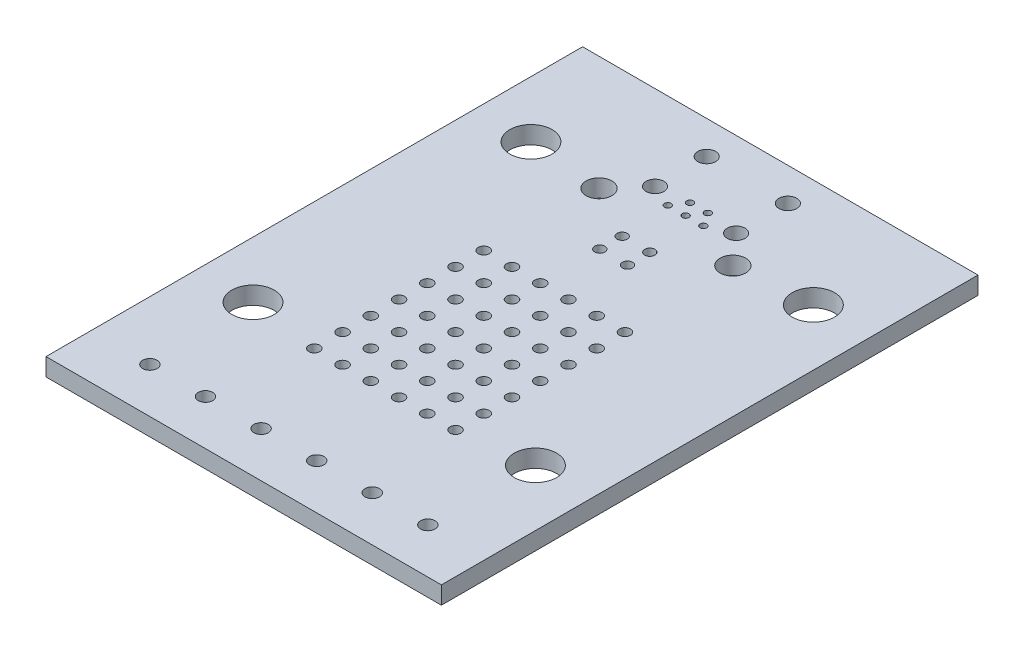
ISO-10303-21;
HEADER;
FILE_DESCRIPTION(('STEP AP214'),'2;1');
FILE_NAME('part.step','',(''),(''),'','','');
FILE_SCHEMA(('AUTOMOTIVE_DESIGN { 1 0 10303 214 1 1 1 1 }'));
ENDSEC;
DATA;
#1=APPLICATION_CONTEXT('core data for automotive mechanical design processes');
#2=APPLICATION_PROTOCOL_DEFINITION('international standard','automotive_design',2000,#1);
#3=PRODUCT_CONTEXT('',#1,'mechanical');
#4=PRODUCT('Part','Part','',(#3));
#5=PRODUCT_RELATED_PRODUCT_CATEGORY('part','',(#4));
#6=PRODUCT_DEFINITION_FORMATION('','',#4);
#7=PRODUCT_DEFINITION_CONTEXT('part definition',#1,'design');
#8=PRODUCT_DEFINITION('design','',#6,#7);
#9=PRODUCT_DEFINITION_SHAPE('','',#8);
#10=(LENGTH_UNIT() NAMED_UNIT(*) SI_UNIT(.MILLI.,.METRE.));
#11=(NAMED_UNIT(*) PLANE_ANGLE_UNIT() SI_UNIT($,.RADIAN.));
#12=(NAMED_UNIT(*) SI_UNIT($,.STERADIAN.) SOLID_ANGLE_UNIT());
#13=UNCERTAINTY_MEASURE_WITH_UNIT(LENGTH_MEASURE(1.E-05),#10,'distance_accuracy_value','');
#14=(GEOMETRIC_REPRESENTATION_CONTEXT(3) GLOBAL_UNCERTAINTY_ASSIGNED_CONTEXT((#13)) GLOBAL_UNIT_ASSIGNED_CONTEXT((#10,
#11,#12)) REPRESENTATION_CONTEXT('',''));
#15=CARTESIAN_POINT('',(0.,0.,0.));
#16=DIRECTION('',(0.,0.,1.));
#17=DIRECTION('',(1.,0.,0.));
#18=AXIS2_PLACEMENT_3D('',#15,#16,#17);
#19=CARTESIAN_POINT('',(-17.78,1.5875,-48.26));
#20=DIRECTION('',(1.,0.,0.));
#21=DIRECTION('',(0.,0.,-1.));
#22=AXIS2_PLACEMENT_3D('',#19,#20,#21);
#23=PLANE('',#22);
#24=DIRECTION('',(0.,0.,1.));
#25=VECTOR('',#24,1.);
#26=CARTESIAN_POINT('',(-17.78,0.,-48.26));
#27=LINE('',#26,#25);
#28=CARTESIAN_POINT('',(-17.78,0.,-48.26));
#29=VERTEX_POINT('',#28);
#30=CARTESIAN_POINT('',(-17.78,0.,0.));
#31=VERTEX_POINT('',#30);
#32=EDGE_CURVE('E96',#29,#31,#27,.T.);
#33=ORIENTED_EDGE('',*,*,#32,.T.);
#34=DIRECTION('',(0.,-1.,0.));
#35=VECTOR('',#34,1.);
#36=CARTESIAN_POINT('',(-17.78,1.5875,0.));
#37=LINE('',#36,#35);
#38=CARTESIAN_POINT('',(-17.78,1.5875,0.));
#39=VERTEX_POINT('',#38);
#40=EDGE_CURVE('E11',#39,#31,#37,.T.);
#41=ORIENTED_EDGE('',*,*,#40,.F.);
#42=DIRECTION('',(0.,0.,1.));
#43=VECTOR('',#42,1.);
#44=CARTESIAN_POINT('',(-17.78,1.5875,-48.26));
#45=LINE('',#44,#43);
#46=CARTESIAN_POINT('',(-17.78,1.5875,-48.26));
#47=VERTEX_POINT('',#46);
#48=EDGE_CURVE('E84',#47,#39,#45,.T.);
#49=ORIENTED_EDGE('',*,*,#48,.F.);
#50=DIRECTION('',(0.,-1.,0.));
#51=VECTOR('',#50,1.);
#52=CARTESIAN_POINT('',(-17.78,1.5875,-48.26));
#53=LINE('',#52,#51);
#54=EDGE_CURVE('E92',#47,#29,#53,.T.);
#55=ORIENTED_EDGE('',*,*,#54,.T.);
#56=EDGE_LOOP('',(#33,#41,#49,#55));
#57=FACE_BOUND('',#56,.T.);
#58=ADVANCED_FACE('F33',(#57),#23,.F.);
#59=CARTESIAN_POINT('',(-17.78,1.5875,0.));
#60=DIRECTION('',(0.,0.,-1.));
#61=DIRECTION('',(-1.,0.,0.));
#62=AXIS2_PLACEMENT_3D('',#59,#60,#61);
#63=PLANE('',#62);
#64=DIRECTION('',(1.,0.,0.));
#65=VECTOR('',#64,1.);
#66=CARTESIAN_POINT('',(-17.78,0.,0.));
#67=LINE('',#66,#65);
#68=CARTESIAN_POINT('',(17.78,0.,0.));
#69=VERTEX_POINT('',#68);
#70=EDGE_CURVE('E88',#31,#69,#67,.T.);
#71=ORIENTED_EDGE('',*,*,#70,.T.);
#72=DIRECTION('',(0.,-1.,0.));
#73=VECTOR('',#72,1.);
#74=CARTESIAN_POINT('',(17.78,1.5875,0.));
#75=LINE('',#74,#73);
#76=CARTESIAN_POINT('',(17.78,1.5875,0.));
#77=VERTEX_POINT('',#76);
#78=EDGE_CURVE('E41',#77,#69,#75,.T.);
#79=ORIENTED_EDGE('',*,*,#78,.F.);
#80=DIRECTION('',(1.,0.,0.));
#81=VECTOR('',#80,1.);
#82=CARTESIAN_POINT('',(-17.78,1.5875,0.));
#83=LINE('',#82,#81);
#84=EDGE_CURVE('E79',#39,#77,#83,.T.);
#85=ORIENTED_EDGE('',*,*,#84,.F.);
#86=ORIENTED_EDGE('',*,*,#40,.T.);
#87=EDGE_LOOP('',(#71,#79,#85,#86));
#88=FACE_BOUND('',#87,.T.);
#89=ADVANCED_FACE('F87',(#88),#63,.F.);
#90=CARTESIAN_POINT('',(17.78,1.5875,-48.26));
#91=DIRECTION('',(-1.,0.,0.));
#92=DIRECTION('',(0.,0.,1.));
#93=AXIS2_PLACEMENT_3D('',#90,#91,#92);
#94=PLANE('',#93);
#95=DIRECTION('',(0.,0.,-1.));
#96=VECTOR('',#95,1.);
#97=CARTESIAN_POINT('',(17.78,0.,-48.26));
#98=LINE('',#97,#96);
#99=CARTESIAN_POINT('',(17.78,0.,-48.26));
#100=VERTEX_POINT('',#99);
#101=EDGE_CURVE('E66',#69,#100,#98,.T.);
#102=ORIENTED_EDGE('',*,*,#101,.T.);
#103=DIRECTION('',(0.,-1.,0.));
#104=VECTOR('',#103,1.);
#105=CARTESIAN_POINT('',(17.78,1.5875,-48.26));
#106=LINE('',#105,#104);
#107=CARTESIAN_POINT('',(17.78,1.5875,-48.26));
#108=VERTEX_POINT('',#107);
#109=EDGE_CURVE('E89',#108,#100,#106,.T.);
#110=ORIENTED_EDGE('',*,*,#109,.F.);
#111=DIRECTION('',(0.,0.,-1.));
#112=VECTOR('',#111,1.);
#113=CARTESIAN_POINT('',(17.78,1.5875,-48.26));
#114=LINE('',#113,#112);
#115=EDGE_CURVE('E82',#77,#108,#114,.T.);
#116=ORIENTED_EDGE('',*,*,#115,.F.);
#117=ORIENTED_EDGE('',*,*,#78,.T.);
#118=EDGE_LOOP('',(#102,#110,#116,#117));
#119=FACE_BOUND('',#118,.T.);
#120=ADVANCED_FACE('F90',(#119),#94,.F.);
#121=CARTESIAN_POINT('',(-17.78,1.5875,-48.26));
#122=DIRECTION('',(0.,0.,1.));
#123=DIRECTION('',(1.,0.,0.));
#124=AXIS2_PLACEMENT_3D('',#121,#122,#123);
#125=PLANE('',#124);
#126=DIRECTION('',(-1.,0.,0.));
#127=VECTOR('',#126,1.);
#128=CARTESIAN_POINT('',(-17.78,0.,-48.26));
#129=LINE('',#128,#127);
#130=EDGE_CURVE('E72',#100,#29,#129,.T.);
#131=ORIENTED_EDGE('',*,*,#130,.T.);
#132=ORIENTED_EDGE('',*,*,#54,.F.);
#133=DIRECTION('',(-1.,0.,0.));
#134=VECTOR('',#133,1.);
#135=CARTESIAN_POINT('',(-17.78,1.5875,-48.26));
#136=LINE('',#135,#134);
#137=EDGE_CURVE('E49',#108,#47,#136,.T.);
#138=ORIENTED_EDGE('',*,*,#137,.F.);
#139=ORIENTED_EDGE('',*,*,#109,.T.);
#140=EDGE_LOOP('',(#131,#132,#138,#139));
#141=FACE_BOUND('',#140,.T.);
#142=ADVANCED_FACE('F104',(#141),#125,.F.);
#143=CARTESIAN_POINT('',(0.,1.5875,0.));
#144=DIRECTION('',(0.,1.,0.));
#145=DIRECTION('',(0.,0.,1.));
#146=AXIS2_PLACEMENT_3D('',#143,#144,#145);
#147=PLANE('',#146);
#148=CARTESIAN_POINT('',(1.6002,1.5875,-39.74084));
#149=DIRECTION('',(0.,1.,0.));
#150=DIRECTION('',(0.,0.,-1.));
#151=AXIS2_PLACEMENT_3D('',#148,#149,#150);
#152=CIRCLE('',#151,0.300000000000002);
#153=CARTESIAN_POINT('',(1.6002,1.5875,-40.04084));
#154=VERTEX_POINT('',#153);
#155=EDGE_CURVE('E506',#154,#154,#152,.T.);
#156=ORIENTED_EDGE('',*,*,#155,.F.);
#157=EDGE_LOOP('',(#156));
#158=FACE_BOUND('',#157,.T.);
#159=CARTESIAN_POINT('',(0.800099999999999,1.5875,-40.93972));
#160=DIRECTION('',(0.,1.,0.));
#161=DIRECTION('',(0.,0.,-1.));
#162=AXIS2_PLACEMENT_3D('',#159,#160,#161);
#163=CIRCLE('',#162,0.300000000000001);
#164=CARTESIAN_POINT('',(0.800099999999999,1.5875,-41.23972));
#165=VERTEX_POINT('',#164);
#166=EDGE_CURVE('E500',#165,#165,#163,.T.);
#167=ORIENTED_EDGE('',*,*,#166,.F.);
#168=EDGE_LOOP('',(#167));
#169=FACE_BOUND('',#168,.T.);
#170=CARTESIAN_POINT('',(3.64998,1.5875,-40.64));
#171=DIRECTION('',(0.,1.,0.));
#172=DIRECTION('',(0.,0.,-1.));
#173=AXIS2_PLACEMENT_3D('',#170,#171,#172);
#174=CIRCLE('',#173,0.800000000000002);
#175=CARTESIAN_POINT('',(3.64998,1.5875,-41.44));
#176=VERTEX_POINT('',#175);
#177=EDGE_CURVE('E494',#176,#176,#174,.T.);
#178=ORIENTED_EDGE('',*,*,#177,.F.);
#179=EDGE_LOOP('',(#178));
#180=FACE_BOUND('',#179,.T.);
#181=CARTESIAN_POINT('',(3.64998,1.5875,-45.29074));
#182=DIRECTION('',(0.,1.,0.));
#183=DIRECTION('',(0.,0.,-1.));
#184=AXIS2_PLACEMENT_3D('',#181,#182,#183);
#185=CIRCLE('',#184,0.800000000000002);
#186=CARTESIAN_POINT('',(3.64998,1.5875,-46.09074));
#187=VERTEX_POINT('',#186);
#188=EDGE_CURVE('E488',#187,#187,#185,.T.);
#189=ORIENTED_EDGE('',*,*,#188,.F.);
#190=EDGE_LOOP('',(#189));
#191=FACE_BOUND('',#190,.T.);
#192=CARTESIAN_POINT('',(-0.800099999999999,1.5875,-40.93972));
#193=DIRECTION('',(0.,1.,0.));
#194=DIRECTION('',(0.,0.,1.));
#195=AXIS2_PLACEMENT_3D('',#192,#193,#194);
#196=CIRCLE('',#195,0.300000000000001);
#197=CARTESIAN_POINT('',(-0.800099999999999,1.5875,-40.63972));
#198=VERTEX_POINT('',#197);
#199=EDGE_CURVE('E482',#198,#198,#196,.T.);
#200=ORIENTED_EDGE('',*,*,#199,.F.);
#201=EDGE_LOOP('',(#200));
#202=FACE_BOUND('',#201,.T.);
#203=CARTESIAN_POINT('',(0.,1.5875,-39.74084));
#204=DIRECTION('',(0.,1.,0.));
#205=DIRECTION('',(0.,0.,1.));
#206=AXIS2_PLACEMENT_3D('',#203,#204,#205);
#207=CIRCLE('',#206,0.300000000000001);
#208=CARTESIAN_POINT('',(0.,1.5875,-39.44084));
#209=VERTEX_POINT('',#208);
#210=EDGE_CURVE('E476',#209,#209,#207,.T.);
#211=ORIENTED_EDGE('',*,*,#210,.F.);
#212=EDGE_LOOP('',(#211));
#213=FACE_BOUND('',#212,.T.);
#214=CARTESIAN_POINT('',(-1.6002,1.5875,-39.74084));
#215=DIRECTION('',(0.,1.,0.));
#216=DIRECTION('',(0.,0.,1.));
#217=AXIS2_PLACEMENT_3D('',#214,#215,#216);
#218=CIRCLE('',#217,0.300000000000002);
#219=CARTESIAN_POINT('',(-1.6002,1.5875,-39.44084));
#220=VERTEX_POINT('',#219);
#221=EDGE_CURVE('E470',#220,#220,#218,.T.);
#222=ORIENTED_EDGE('',*,*,#221,.F.);
#223=EDGE_LOOP('',(#222));
#224=FACE_BOUND('',#223,.T.);
#225=CARTESIAN_POINT('',(-3.64998,1.5875,-45.29074));
#226=DIRECTION('',(0.,1.,0.));
#227=DIRECTION('',(0.,0.,1.));
#228=AXIS2_PLACEMENT_3D('',#225,#226,#227);
#229=CIRCLE('',#228,0.800000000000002);
#230=CARTESIAN_POINT('',(-3.64998,1.5875,-44.49074));
#231=VERTEX_POINT('',#230);
#232=EDGE_CURVE('E464',#231,#231,#229,.T.);
#233=ORIENTED_EDGE('',*,*,#232,.F.);
#234=EDGE_LOOP('',(#233));
#235=FACE_BOUND('',#234,.T.);
#236=CARTESIAN_POINT('',(-3.64998,1.5875,-40.64));
#237=DIRECTION('',(0.,1.,0.));
#238=DIRECTION('',(0.,0.,1.));
#239=AXIS2_PLACEMENT_3D('',#236,#237,#238);
#240=CIRCLE('',#239,0.800000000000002);
#241=CARTESIAN_POINT('',(-3.64998,1.5875,-39.84));
#242=VERTEX_POINT('',#241);
#243=EDGE_CURVE('E458',#242,#242,#240,.T.);
#244=ORIENTED_EDGE('',*,*,#243,.F.);
#245=EDGE_LOOP('',(#244));
#246=FACE_BOUND('',#245,.T.);
#247=CARTESIAN_POINT('',(6.0198,1.5875,-37.973));
#248=DIRECTION('',(0.,1.,0.));
#249=DIRECTION('',(0.,0.,-1.));
#250=AXIS2_PLACEMENT_3D('',#247,#248,#249);
#251=CIRCLE('',#250,1.1557);
#252=CARTESIAN_POINT('',(6.0198,1.5875,-39.1287));
#253=VERTEX_POINT('',#252);
#254=EDGE_CURVE('E452',#253,#253,#251,.T.);
#255=ORIENTED_EDGE('',*,*,#254,.F.);
#256=EDGE_LOOP('',(#255));
#257=FACE_BOUND('',#256,.T.);
#258=CARTESIAN_POINT('',(1.2446,1.5875,-35.2806));
#259=DIRECTION('',(0.,1.,0.));
#260=DIRECTION('',(0.,0.,-1.));
#261=AXIS2_PLACEMENT_3D('',#258,#259,#260);
#262=CIRCLE('',#261,0.457199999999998);
#263=CARTESIAN_POINT('',(1.2446,1.5875,-35.7378));
#264=VERTEX_POINT('',#263);
#265=EDGE_CURVE('E446',#264,#264,#262,.T.);
#266=ORIENTED_EDGE('',*,*,#265,.F.);
#267=EDGE_LOOP('',(#266));
#268=FACE_BOUND('',#267,.T.);
#269=CARTESIAN_POINT('',(1.2446,1.5875,-33.274));
#270=DIRECTION('',(0.,1.,0.));
#271=DIRECTION('',(0.,0.,-1.));
#272=AXIS2_PLACEMENT_3D('',#269,#270,#271);
#273=CIRCLE('',#272,0.457199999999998);
#274=CARTESIAN_POINT('',(1.2446,1.5875,-33.7312));
#275=VERTEX_POINT('',#274);
#276=EDGE_CURVE('E440',#275,#275,#273,.T.);
#277=ORIENTED_EDGE('',*,*,#276,.F.);
#278=EDGE_LOOP('',(#277));
#279=FACE_BOUND('',#278,.T.);
#280=CARTESIAN_POINT('',(-6.0198,1.5875,-37.973));
#281=DIRECTION('',(0.,1.,0.));
#282=DIRECTION('',(0.,0.,1.));
#283=AXIS2_PLACEMENT_3D('',#280,#281,#282);
#284=CIRCLE('',#283,1.1557);
#285=CARTESIAN_POINT('',(-6.0198,1.5875,-36.8173));
#286=VERTEX_POINT('',#285);
#287=EDGE_CURVE('E434',#286,#286,#284,.T.);
#288=ORIENTED_EDGE('',*,*,#287,.F.);
#289=EDGE_LOOP('',(#288));
#290=FACE_BOUND('',#289,.T.);
#291=CARTESIAN_POINT('',(-1.2446,1.5875,-35.2806));
#292=DIRECTION('',(0.,1.,0.));
#293=DIRECTION('',(0.,0.,1.));
#294=AXIS2_PLACEMENT_3D('',#291,#292,#293);
#295=CIRCLE('',#294,0.457199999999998);
#296=CARTESIAN_POINT('',(-1.2446,1.5875,-34.8234));
#297=VERTEX_POINT('',#296);
#298=EDGE_CURVE('E428',#297,#297,#295,.T.);
#299=ORIENTED_EDGE('',*,*,#298,.F.);
#300=EDGE_LOOP('',(#299));
#301=FACE_BOUND('',#300,.T.);
#302=CARTESIAN_POINT('',(-1.2446,1.5875,-33.274));
#303=DIRECTION('',(0.,1.,0.));
#304=DIRECTION('',(0.,0.,1.));
#305=AXIS2_PLACEMENT_3D('',#302,#303,#304);
#306=CIRCLE('',#305,0.457199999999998);
#307=CARTESIAN_POINT('',(-1.2446,1.5875,-32.8168));
#308=VERTEX_POINT('',#307);
#309=EDGE_CURVE('E422',#308,#308,#306,.T.);
#310=ORIENTED_EDGE('',*,*,#309,.F.);
#311=EDGE_LOOP('',(#310));
#312=FACE_BOUND('',#311,.T.);
#313=CARTESIAN_POINT('',(-6.35000000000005,1.5875,-27.94));
#314=DIRECTION('',(0.,1.,0.));
#315=DIRECTION('',(0.,0.,1.));
#316=AXIS2_PLACEMENT_3D('',#313,#314,#315);
#317=CIRCLE('',#316,0.495299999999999);
#318=CARTESIAN_POINT('',(-6.35000000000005,1.5875,-27.4447));
#319=VERTEX_POINT('',#318);
#320=EDGE_CURVE('E416',#319,#319,#317,.T.);
#321=ORIENTED_EDGE('',*,*,#320,.F.);
#322=EDGE_LOOP('',(#321));
#323=FACE_BOUND('',#322,.T.);
#324=CARTESIAN_POINT('',(-6.35000000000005,1.5875,-25.4));
#325=DIRECTION('',(0.,1.,0.));
#326=DIRECTION('',(0.,0.,1.));
#327=AXIS2_PLACEMENT_3D('',#324,#325,#326);
#328=CIRCLE('',#327,0.4953);
#329=CARTESIAN_POINT('',(-6.35000000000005,1.5875,-24.9047));
#330=VERTEX_POINT('',#329);
#331=EDGE_CURVE('E410',#330,#330,#328,.T.);
#332=ORIENTED_EDGE('',*,*,#331,.F.);
#333=EDGE_LOOP('',(#332));
#334=FACE_BOUND('',#333,.T.);
#335=CARTESIAN_POINT('',(-6.35000000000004,1.5875,-22.86));
#336=DIRECTION('',(0.,1.,0.));
#337=DIRECTION('',(0.,0.,1.));
#338=AXIS2_PLACEMENT_3D('',#335,#336,#337);
#339=CIRCLE('',#338,0.4953);
#340=CARTESIAN_POINT('',(-6.35000000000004,1.5875,-22.3647));
#341=VERTEX_POINT('',#340);
#342=EDGE_CURVE('E404',#341,#341,#339,.T.);
#343=ORIENTED_EDGE('',*,*,#342,.F.);
#344=EDGE_LOOP('',(#343));
#345=FACE_BOUND('',#344,.T.);
#346=CARTESIAN_POINT('',(-6.35000000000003,1.5875,-20.32));
#347=DIRECTION('',(0.,1.,0.));
#348=DIRECTION('',(0.,0.,1.));
#349=AXIS2_PLACEMENT_3D('',#346,#347,#348);
#350=CIRCLE('',#349,0.4953);
#351=CARTESIAN_POINT('',(-6.35000000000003,1.5875,-19.8247));
#352=VERTEX_POINT('',#351);
#353=EDGE_CURVE('E398',#352,#352,#350,.T.);
#354=ORIENTED_EDGE('',*,*,#353,.F.);
#355=EDGE_LOOP('',(#354));
#356=FACE_BOUND('',#355,.T.);
#357=CARTESIAN_POINT('',(-6.35000000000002,1.5875,-17.78));
#358=DIRECTION('',(0.,1.,0.));
#359=DIRECTION('',(0.,0.,1.));
#360=AXIS2_PLACEMENT_3D('',#357,#358,#359);
#361=CIRCLE('',#360,0.495299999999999);
#362=CARTESIAN_POINT('',(-6.35000000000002,1.5875,-17.2847));
#363=VERTEX_POINT('',#362);
#364=EDGE_CURVE('E392',#363,#363,#361,.T.);
#365=ORIENTED_EDGE('',*,*,#364,.F.);
#366=EDGE_LOOP('',(#365));
#367=FACE_BOUND('',#366,.T.);
#368=CARTESIAN_POINT('',(-6.35000000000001,1.5875,-15.24));
#369=DIRECTION('',(0.,1.,0.));
#370=DIRECTION('',(0.,0.,1.));
#371=AXIS2_PLACEMENT_3D('',#368,#369,#370);
#372=CIRCLE('',#371,0.495299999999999);
#373=CARTESIAN_POINT('',(-6.35000000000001,1.5875,-14.7447));
#374=VERTEX_POINT('',#373);
#375=EDGE_CURVE('E386',#374,#374,#372,.T.);
#376=ORIENTED_EDGE('',*,*,#375,.F.);
#377=EDGE_LOOP('',(#376));
#378=FACE_BOUND('',#377,.T.);
#379=CARTESIAN_POINT('',(6.34999999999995,1.5875,-27.94));
#380=DIRECTION('',(0.,1.,0.));
#381=DIRECTION('',(0.,0.,1.));
#382=AXIS2_PLACEMENT_3D('',#379,#380,#381);
#383=CIRCLE('',#382,0.495299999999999);
#384=CARTESIAN_POINT('',(6.34999999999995,1.5875,-27.4447));
#385=VERTEX_POINT('',#384);
#386=EDGE_CURVE('E380',#385,#385,#383,.T.);
#387=ORIENTED_EDGE('',*,*,#386,.F.);
#388=EDGE_LOOP('',(#387));
#389=FACE_BOUND('',#388,.T.);
#390=CARTESIAN_POINT('',(3.80999999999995,1.5875,-27.94));
#391=DIRECTION('',(0.,1.,0.));
#392=DIRECTION('',(0.,0.,1.));
#393=AXIS2_PLACEMENT_3D('',#390,#391,#392);
#394=CIRCLE('',#393,0.495299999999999);
#395=CARTESIAN_POINT('',(3.80999999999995,1.5875,-27.4447));
#396=VERTEX_POINT('',#395);
#397=EDGE_CURVE('E374',#396,#396,#394,.T.);
#398=ORIENTED_EDGE('',*,*,#397,.F.);
#399=EDGE_LOOP('',(#398));
#400=FACE_BOUND('',#399,.T.);
#401=CARTESIAN_POINT('',(1.26999999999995,1.5875,-27.94));
#402=DIRECTION('',(0.,1.,0.));
#403=DIRECTION('',(0.,0.,1.));
#404=AXIS2_PLACEMENT_3D('',#401,#402,#403);
#405=CIRCLE('',#404,0.495299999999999);
#406=CARTESIAN_POINT('',(1.26999999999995,1.5875,-27.4447));
#407=VERTEX_POINT('',#406);
#408=EDGE_CURVE('E368',#407,#407,#405,.T.);
#409=ORIENTED_EDGE('',*,*,#408,.F.);
#410=EDGE_LOOP('',(#409));
#411=FACE_BOUND('',#410,.T.);
#412=CARTESIAN_POINT('',(-1.27000000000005,1.5875,-27.94));
#413=DIRECTION('',(0.,1.,0.));
#414=DIRECTION('',(0.,0.,1.));
#415=AXIS2_PLACEMENT_3D('',#412,#413,#414);
#416=CIRCLE('',#415,0.495299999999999);
#417=CARTESIAN_POINT('',(-1.27000000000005,1.5875,-27.4447));
#418=VERTEX_POINT('',#417);
#419=EDGE_CURVE('E362',#418,#418,#416,.T.);
#420=ORIENTED_EDGE('',*,*,#419,.F.);
#421=EDGE_LOOP('',(#420));
#422=FACE_BOUND('',#421,.T.);
#423=CARTESIAN_POINT('',(-3.81000000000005,1.5875,-27.94));
#424=DIRECTION('',(0.,1.,0.));
#425=DIRECTION('',(0.,0.,1.));
#426=AXIS2_PLACEMENT_3D('',#423,#424,#425);
#427=CIRCLE('',#426,0.495299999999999);
#428=CARTESIAN_POINT('',(-3.81000000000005,1.5875,-27.4447));
#429=VERTEX_POINT('',#428);
#430=EDGE_CURVE('E356',#429,#429,#427,.T.);
#431=ORIENTED_EDGE('',*,*,#430,.F.);
#432=EDGE_LOOP('',(#431));
#433=FACE_BOUND('',#432,.T.);
#434=CARTESIAN_POINT('',(6.34999999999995,1.5875,-25.4));
#435=DIRECTION('',(0.,1.,0.));
#436=DIRECTION('',(0.,0.,1.));
#437=AXIS2_PLACEMENT_3D('',#434,#435,#436);
#438=CIRCLE('',#437,0.4953);
#439=CARTESIAN_POINT('',(6.34999999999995,1.5875,-24.9047));
#440=VERTEX_POINT('',#439);
#441=EDGE_CURVE('E350',#440,#440,#438,.T.);
#442=ORIENTED_EDGE('',*,*,#441,.F.);
#443=EDGE_LOOP('',(#442));
#444=FACE_BOUND('',#443,.T.);
#445=CARTESIAN_POINT('',(3.80999999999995,1.5875,-25.4));
#446=DIRECTION('',(0.,1.,0.));
#447=DIRECTION('',(0.,0.,1.));
#448=AXIS2_PLACEMENT_3D('',#445,#446,#447);
#449=CIRCLE('',#448,0.4953);
#450=CARTESIAN_POINT('',(3.80999999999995,1.5875,-24.9047));
#451=VERTEX_POINT('',#450);
#452=EDGE_CURVE('E344',#451,#451,#449,.T.);
#453=ORIENTED_EDGE('',*,*,#452,.F.);
#454=EDGE_LOOP('',(#453));
#455=FACE_BOUND('',#454,.T.);
#456=CARTESIAN_POINT('',(1.26999999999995,1.5875,-25.4));
#457=DIRECTION('',(0.,1.,0.));
#458=DIRECTION('',(0.,0.,1.));
#459=AXIS2_PLACEMENT_3D('',#456,#457,#458);
#460=CIRCLE('',#459,0.4953);
#461=CARTESIAN_POINT('',(1.26999999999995,1.5875,-24.9047));
#462=VERTEX_POINT('',#461);
#463=EDGE_CURVE('E338',#462,#462,#460,.T.);
#464=ORIENTED_EDGE('',*,*,#463,.F.);
#465=EDGE_LOOP('',(#464));
#466=FACE_BOUND('',#465,.T.);
#467=CARTESIAN_POINT('',(-1.27000000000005,1.5875,-25.4));
#468=DIRECTION('',(0.,1.,0.));
#469=DIRECTION('',(0.,0.,1.));
#470=AXIS2_PLACEMENT_3D('',#467,#468,#469);
#471=CIRCLE('',#470,0.4953);
#472=CARTESIAN_POINT('',(-1.27000000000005,1.5875,-24.9047));
#473=VERTEX_POINT('',#472);
#474=EDGE_CURVE('E332',#473,#473,#471,.T.);
#475=ORIENTED_EDGE('',*,*,#474,.F.);
#476=EDGE_LOOP('',(#475));
#477=FACE_BOUND('',#476,.T.);
#478=CARTESIAN_POINT('',(-3.81000000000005,1.5875,-25.4));
#479=DIRECTION('',(0.,1.,0.));
#480=DIRECTION('',(0.,0.,1.));
#481=AXIS2_PLACEMENT_3D('',#478,#479,#480);
#482=CIRCLE('',#481,0.4953);
#483=CARTESIAN_POINT('',(-3.81000000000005,1.5875,-24.9047));
#484=VERTEX_POINT('',#483);
#485=EDGE_CURVE('E326',#484,#484,#482,.T.);
#486=ORIENTED_EDGE('',*,*,#485,.F.);
#487=EDGE_LOOP('',(#486));
#488=FACE_BOUND('',#487,.T.);
#489=CARTESIAN_POINT('',(6.34999999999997,1.5875,-22.86));
#490=DIRECTION('',(0.,1.,0.));
#491=DIRECTION('',(0.,0.,1.));
#492=AXIS2_PLACEMENT_3D('',#489,#490,#491);
#493=CIRCLE('',#492,0.4953);
#494=CARTESIAN_POINT('',(6.34999999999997,1.5875,-22.3647));
#495=VERTEX_POINT('',#494);
#496=EDGE_CURVE('E320',#495,#495,#493,.T.);
#497=ORIENTED_EDGE('',*,*,#496,.F.);
#498=EDGE_LOOP('',(#497));
#499=FACE_BOUND('',#498,.T.);
#500=CARTESIAN_POINT('',(3.80999999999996,1.5875,-22.86));
#501=DIRECTION('',(0.,1.,0.));
#502=DIRECTION('',(0.,0.,1.));
#503=AXIS2_PLACEMENT_3D('',#500,#501,#502);
#504=CIRCLE('',#503,0.4953);
#505=CARTESIAN_POINT('',(3.80999999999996,1.5875,-22.3647));
#506=VERTEX_POINT('',#505);
#507=EDGE_CURVE('E314',#506,#506,#504,.T.);
#508=ORIENTED_EDGE('',*,*,#507,.F.);
#509=EDGE_LOOP('',(#508));
#510=FACE_BOUND('',#509,.T.);
#511=CARTESIAN_POINT('',(1.26999999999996,1.5875,-22.86));
#512=DIRECTION('',(0.,1.,0.));
#513=DIRECTION('',(0.,0.,1.));
#514=AXIS2_PLACEMENT_3D('',#511,#512,#513);
#515=CIRCLE('',#514,0.4953);
#516=CARTESIAN_POINT('',(1.26999999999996,1.5875,-22.3647));
#517=VERTEX_POINT('',#516);
#518=EDGE_CURVE('E308',#517,#517,#515,.T.);
#519=ORIENTED_EDGE('',*,*,#518,.F.);
#520=EDGE_LOOP('',(#519));
#521=FACE_BOUND('',#520,.T.);
#522=CARTESIAN_POINT('',(-1.27000000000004,1.5875,-22.86));
#523=DIRECTION('',(0.,1.,0.));
#524=DIRECTION('',(0.,0.,1.));
#525=AXIS2_PLACEMENT_3D('',#522,#523,#524);
#526=CIRCLE('',#525,0.4953);
#527=CARTESIAN_POINT('',(-1.27000000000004,1.5875,-22.3647));
#528=VERTEX_POINT('',#527);
#529=EDGE_CURVE('E302',#528,#528,#526,.T.);
#530=ORIENTED_EDGE('',*,*,#529,.F.);
#531=EDGE_LOOP('',(#530));
#532=FACE_BOUND('',#531,.T.);
#533=CARTESIAN_POINT('',(-3.81000000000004,1.5875,-22.86));
#534=DIRECTION('',(0.,1.,0.));
#535=DIRECTION('',(0.,0.,1.));
#536=AXIS2_PLACEMENT_3D('',#533,#534,#535);
#537=CIRCLE('',#536,0.4953);
#538=CARTESIAN_POINT('',(-3.81000000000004,1.5875,-22.3647));
#539=VERTEX_POINT('',#538);
#540=EDGE_CURVE('E296',#539,#539,#537,.T.);
#541=ORIENTED_EDGE('',*,*,#540,.F.);
#542=EDGE_LOOP('',(#541));
#543=FACE_BOUND('',#542,.T.);
#544=CARTESIAN_POINT('',(6.34999999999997,1.5875,-20.32));
#545=DIRECTION('',(0.,1.,0.));
#546=DIRECTION('',(0.,0.,1.));
#547=AXIS2_PLACEMENT_3D('',#544,#545,#546);
#548=CIRCLE('',#547,0.4953);
#549=CARTESIAN_POINT('',(6.34999999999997,1.5875,-19.8247));
#550=VERTEX_POINT('',#549);
#551=EDGE_CURVE('E290',#550,#550,#548,.T.);
#552=ORIENTED_EDGE('',*,*,#551,.F.);
#553=EDGE_LOOP('',(#552));
#554=FACE_BOUND('',#553,.T.);
#555=CARTESIAN_POINT('',(3.80999999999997,1.5875,-20.32));
#556=DIRECTION('',(0.,1.,0.));
#557=DIRECTION('',(0.,0.,1.));
#558=AXIS2_PLACEMENT_3D('',#555,#556,#557);
#559=CIRCLE('',#558,0.4953);
#560=CARTESIAN_POINT('',(3.80999999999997,1.5875,-19.8247));
#561=VERTEX_POINT('',#560);
#562=EDGE_CURVE('E284',#561,#561,#559,.T.);
#563=ORIENTED_EDGE('',*,*,#562,.F.);
#564=EDGE_LOOP('',(#563));
#565=FACE_BOUND('',#564,.T.);
#566=CARTESIAN_POINT('',(1.26999999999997,1.5875,-20.32));
#567=DIRECTION('',(0.,1.,0.));
#568=DIRECTION('',(0.,0.,1.));
#569=AXIS2_PLACEMENT_3D('',#566,#567,#568);
#570=CIRCLE('',#569,0.4953);
#571=CARTESIAN_POINT('',(1.26999999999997,1.5875,-19.8247));
#572=VERTEX_POINT('',#571);
#573=EDGE_CURVE('E278',#572,#572,#570,.T.);
#574=ORIENTED_EDGE('',*,*,#573,.F.);
#575=EDGE_LOOP('',(#574));
#576=FACE_BOUND('',#575,.T.);
#577=CARTESIAN_POINT('',(-1.27000000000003,1.5875,-20.32));
#578=DIRECTION('',(0.,1.,0.));
#579=DIRECTION('',(0.,0.,1.));
#580=AXIS2_PLACEMENT_3D('',#577,#578,#579);
#581=CIRCLE('',#580,0.4953);
#582=CARTESIAN_POINT('',(-1.27000000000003,1.5875,-19.8247));
#583=VERTEX_POINT('',#582);
#584=EDGE_CURVE('E272',#583,#583,#581,.T.);
#585=ORIENTED_EDGE('',*,*,#584,.F.);
#586=EDGE_LOOP('',(#585));
#587=FACE_BOUND('',#586,.T.);
#588=CARTESIAN_POINT('',(-3.81000000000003,1.5875,-20.32));
#589=DIRECTION('',(0.,1.,0.));
#590=DIRECTION('',(0.,0.,1.));
#591=AXIS2_PLACEMENT_3D('',#588,#589,#590);
#592=CIRCLE('',#591,0.4953);
#593=CARTESIAN_POINT('',(-3.81000000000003,1.5875,-19.8247));
#594=VERTEX_POINT('',#593);
#595=EDGE_CURVE('E266',#594,#594,#592,.T.);
#596=ORIENTED_EDGE('',*,*,#595,.F.);
#597=EDGE_LOOP('',(#596));
#598=FACE_BOUND('',#597,.T.);
#599=CARTESIAN_POINT('',(6.34999999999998,1.5875,-17.78));
#600=DIRECTION('',(0.,1.,0.));
#601=DIRECTION('',(0.,0.,1.));
#602=AXIS2_PLACEMENT_3D('',#599,#600,#601);
#603=CIRCLE('',#602,0.495299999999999);
#604=CARTESIAN_POINT('',(6.34999999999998,1.5875,-17.2847));
#605=VERTEX_POINT('',#604);
#606=EDGE_CURVE('E260',#605,#605,#603,.T.);
#607=ORIENTED_EDGE('',*,*,#606,.F.);
#608=EDGE_LOOP('',(#607));
#609=FACE_BOUND('',#608,.T.);
#610=CARTESIAN_POINT('',(3.80999999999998,1.5875,-17.78));
#611=DIRECTION('',(0.,1.,0.));
#612=DIRECTION('',(0.,0.,1.));
#613=AXIS2_PLACEMENT_3D('',#610,#611,#612);
#614=CIRCLE('',#613,0.495299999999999);
#615=CARTESIAN_POINT('',(3.80999999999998,1.5875,-17.2847));
#616=VERTEX_POINT('',#615);
#617=EDGE_CURVE('E254',#616,#616,#614,.T.);
#618=ORIENTED_EDGE('',*,*,#617,.F.);
#619=EDGE_LOOP('',(#618));
#620=FACE_BOUND('',#619,.T.);
#621=CARTESIAN_POINT('',(1.26999999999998,1.5875,-17.78));
#622=DIRECTION('',(0.,1.,0.));
#623=DIRECTION('',(0.,0.,1.));
#624=AXIS2_PLACEMENT_3D('',#621,#622,#623);
#625=CIRCLE('',#624,0.495299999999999);
#626=CARTESIAN_POINT('',(1.26999999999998,1.5875,-17.2847));
#627=VERTEX_POINT('',#626);
#628=EDGE_CURVE('E248',#627,#627,#625,.T.);
#629=ORIENTED_EDGE('',*,*,#628,.F.);
#630=EDGE_LOOP('',(#629));
#631=FACE_BOUND('',#630,.T.);
#632=CARTESIAN_POINT('',(-1.27000000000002,1.5875,-17.78));
#633=DIRECTION('',(0.,1.,0.));
#634=DIRECTION('',(0.,0.,1.));
#635=AXIS2_PLACEMENT_3D('',#632,#633,#634);
#636=CIRCLE('',#635,0.495299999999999);
#637=CARTESIAN_POINT('',(-1.27000000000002,1.5875,-17.2847));
#638=VERTEX_POINT('',#637);
#639=EDGE_CURVE('E242',#638,#638,#636,.T.);
#640=ORIENTED_EDGE('',*,*,#639,.F.);
#641=EDGE_LOOP('',(#640));
#642=FACE_BOUND('',#641,.T.);
#643=CARTESIAN_POINT('',(-3.81000000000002,1.5875,-17.78));
#644=DIRECTION('',(0.,1.,0.));
#645=DIRECTION('',(0.,0.,1.));
#646=AXIS2_PLACEMENT_3D('',#643,#644,#645);
#647=CIRCLE('',#646,0.495299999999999);
#648=CARTESIAN_POINT('',(-3.81000000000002,1.5875,-17.2847));
#649=VERTEX_POINT('',#648);
#650=EDGE_CURVE('E236',#649,#649,#647,.T.);
#651=ORIENTED_EDGE('',*,*,#650,.F.);
#652=EDGE_LOOP('',(#651));
#653=FACE_BOUND('',#652,.T.);
#654=CARTESIAN_POINT('',(6.34999999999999,1.5875,-15.24));
#655=DIRECTION('',(0.,1.,0.));
#656=DIRECTION('',(0.,0.,1.));
#657=AXIS2_PLACEMENT_3D('',#654,#655,#656);
#658=CIRCLE('',#657,0.495299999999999);
#659=CARTESIAN_POINT('',(6.34999999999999,1.5875,-14.7447));
#660=VERTEX_POINT('',#659);
#661=EDGE_CURVE('E230',#660,#660,#658,.T.);
#662=ORIENTED_EDGE('',*,*,#661,.F.);
#663=EDGE_LOOP('',(#662));
#664=FACE_BOUND('',#663,.T.);
#665=CARTESIAN_POINT('',(3.80999999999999,1.5875,-15.24));
#666=DIRECTION('',(0.,1.,0.));
#667=DIRECTION('',(0.,0.,1.));
#668=AXIS2_PLACEMENT_3D('',#665,#666,#667);
#669=CIRCLE('',#668,0.495299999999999);
#670=CARTESIAN_POINT('',(3.80999999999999,1.5875,-14.7447));
#671=VERTEX_POINT('',#670);
#672=EDGE_CURVE('E224',#671,#671,#669,.T.);
#673=ORIENTED_EDGE('',*,*,#672,.F.);
#674=EDGE_LOOP('',(#673));
#675=FACE_BOUND('',#674,.T.);
#676=CARTESIAN_POINT('',(1.26999999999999,1.5875,-15.24));
#677=DIRECTION('',(0.,1.,0.));
#678=DIRECTION('',(0.,0.,1.));
#679=AXIS2_PLACEMENT_3D('',#676,#677,#678);
#680=CIRCLE('',#679,0.495299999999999);
#681=CARTESIAN_POINT('',(1.26999999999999,1.5875,-14.7447));
#682=VERTEX_POINT('',#681);
#683=EDGE_CURVE('E218',#682,#682,#680,.T.);
#684=ORIENTED_EDGE('',*,*,#683,.F.);
#685=EDGE_LOOP('',(#684));
#686=FACE_BOUND('',#685,.T.);
#687=CARTESIAN_POINT('',(-1.27000000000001,1.5875,-15.24));
#688=DIRECTION('',(0.,1.,0.));
#689=DIRECTION('',(0.,0.,1.));
#690=AXIS2_PLACEMENT_3D('',#687,#688,#689);
#691=CIRCLE('',#690,0.495299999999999);
#692=CARTESIAN_POINT('',(-1.27000000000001,1.5875,-14.7447));
#693=VERTEX_POINT('',#692);
#694=EDGE_CURVE('E212',#693,#693,#691,.T.);
#695=ORIENTED_EDGE('',*,*,#694,.F.);
#696=EDGE_LOOP('',(#695));
#697=FACE_BOUND('',#696,.T.);
#698=CARTESIAN_POINT('',(-3.81000000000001,1.5875,-15.24));
#699=DIRECTION('',(0.,1.,0.));
#700=DIRECTION('',(0.,0.,1.));
#701=AXIS2_PLACEMENT_3D('',#698,#699,#700);
#702=CIRCLE('',#701,0.495299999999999);
#703=CARTESIAN_POINT('',(-3.81000000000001,1.5875,-14.7447));
#704=VERTEX_POINT('',#703);
#705=EDGE_CURVE('E206',#704,#704,#702,.T.);
#706=ORIENTED_EDGE('',*,*,#705,.F.);
#707=EDGE_LOOP('',(#706));
#708=FACE_BOUND('',#707,.T.);
#709=CARTESIAN_POINT('',(6.35,1.5875,-12.7));
#710=DIRECTION('',(0.,1.,0.));
#711=DIRECTION('',(0.,0.,1.));
#712=AXIS2_PLACEMENT_3D('',#709,#710,#711);
#713=CIRCLE('',#712,0.495299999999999);
#714=CARTESIAN_POINT('',(6.35,1.5875,-12.2047));
#715=VERTEX_POINT('',#714);
#716=EDGE_CURVE('E200',#715,#715,#713,.T.);
#717=ORIENTED_EDGE('',*,*,#716,.F.);
#718=EDGE_LOOP('',(#717));
#719=FACE_BOUND('',#718,.T.);
#720=CARTESIAN_POINT('',(3.81,1.5875,-12.7));
#721=DIRECTION('',(0.,1.,0.));
#722=DIRECTION('',(0.,0.,1.));
#723=AXIS2_PLACEMENT_3D('',#720,#721,#722);
#724=CIRCLE('',#723,0.495299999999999);
#725=CARTESIAN_POINT('',(3.81,1.5875,-12.2047));
#726=VERTEX_POINT('',#725);
#727=EDGE_CURVE('E194',#726,#726,#724,.T.);
#728=ORIENTED_EDGE('',*,*,#727,.F.);
#729=EDGE_LOOP('',(#728));
#730=FACE_BOUND('',#729,.T.);
#731=CARTESIAN_POINT('',(1.27,1.5875,-12.7));
#732=DIRECTION('',(0.,1.,0.));
#733=DIRECTION('',(0.,0.,1.));
#734=AXIS2_PLACEMENT_3D('',#731,#732,#733);
#735=CIRCLE('',#734,0.495299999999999);
#736=CARTESIAN_POINT('',(1.27,1.5875,-12.2047));
#737=VERTEX_POINT('',#736);
#738=EDGE_CURVE('E188',#737,#737,#735,.T.);
#739=ORIENTED_EDGE('',*,*,#738,.F.);
#740=EDGE_LOOP('',(#739));
#741=FACE_BOUND('',#740,.T.);
#742=CARTESIAN_POINT('',(-1.27,1.5875,-12.7));
#743=DIRECTION('',(0.,1.,0.));
#744=DIRECTION('',(0.,0.,1.));
#745=AXIS2_PLACEMENT_3D('',#742,#743,#744);
#746=CIRCLE('',#745,0.495299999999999);
#747=CARTESIAN_POINT('',(-1.27,1.5875,-12.2047));
#748=VERTEX_POINT('',#747);
#749=EDGE_CURVE('E182',#748,#748,#746,.T.);
#750=ORIENTED_EDGE('',*,*,#749,.F.);
#751=EDGE_LOOP('',(#750));
#752=FACE_BOUND('',#751,.T.);
#753=CARTESIAN_POINT('',(-3.81,1.5875,-12.7));
#754=DIRECTION('',(0.,1.,0.));
#755=DIRECTION('',(0.,0.,1.));
#756=AXIS2_PLACEMENT_3D('',#753,#754,#755);
#757=CIRCLE('',#756,0.495299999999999);
#758=CARTESIAN_POINT('',(-3.81,1.5875,-12.2047));
#759=VERTEX_POINT('',#758);
#760=EDGE_CURVE('E176',#759,#759,#757,.T.);
#761=ORIENTED_EDGE('',*,*,#760,.F.);
#762=EDGE_LOOP('',(#761));
#763=FACE_BOUND('',#762,.T.);
#764=CARTESIAN_POINT('',(-6.35,1.5875,-12.7));
#765=DIRECTION('',(0.,1.,0.));
#766=DIRECTION('',(0.,0.,1.));
#767=AXIS2_PLACEMENT_3D('',#764,#765,#766);
#768=CIRCLE('',#767,0.495299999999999);
#769=CARTESIAN_POINT('',(-6.35,1.5875,-12.2047));
#770=VERTEX_POINT('',#769);
#771=EDGE_CURVE('E170',#770,#770,#768,.T.);
#772=ORIENTED_EDGE('',*,*,#771,.F.);
#773=EDGE_LOOP('',(#772));
#774=FACE_BOUND('',#773,.T.);
#775=CARTESIAN_POINT('',(12.49934,1.5875,-4.064));
#776=DIRECTION('',(0.,1.,0.));
#777=DIRECTION('',(0.,0.,-1.));
#778=AXIS2_PLACEMENT_3D('',#775,#776,#777);
#779=CIRCLE('',#778,0.649999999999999);
#780=CARTESIAN_POINT('',(12.49934,1.5875,-4.714));
#781=VERTEX_POINT('',#780);
#782=EDGE_CURVE('E164',#781,#781,#779,.T.);
#783=ORIENTED_EDGE('',*,*,#782,.F.);
#784=EDGE_LOOP('',(#783));
#785=FACE_BOUND('',#784,.T.);
#786=CARTESIAN_POINT('',(7.50062,1.5875,-4.064));
#787=DIRECTION('',(0.,1.,0.));
#788=DIRECTION('',(0.,0.,-1.));
#789=AXIS2_PLACEMENT_3D('',#786,#787,#788);
#790=CIRCLE('',#789,0.65);
#791=CARTESIAN_POINT('',(7.50062,1.5875,-4.714));
#792=VERTEX_POINT('',#791);
#793=EDGE_CURVE('E158',#792,#792,#790,.T.);
#794=ORIENTED_EDGE('',*,*,#793,.F.);
#795=EDGE_LOOP('',(#794));
#796=FACE_BOUND('',#795,.T.);
#797=CARTESIAN_POINT('',(2.49936,1.5875,-4.064));
#798=DIRECTION('',(0.,1.,0.));
#799=DIRECTION('',(0.,0.,-1.));
#800=AXIS2_PLACEMENT_3D('',#797,#798,#799);
#801=CIRCLE('',#800,0.65);
#802=CARTESIAN_POINT('',(2.49936,1.5875,-4.714));
#803=VERTEX_POINT('',#802);
#804=EDGE_CURVE('E152',#803,#803,#801,.T.);
#805=ORIENTED_EDGE('',*,*,#804,.F.);
#806=EDGE_LOOP('',(#805));
#807=FACE_BOUND('',#806,.T.);
#808=CARTESIAN_POINT('',(12.7,1.5875,-13.5382));
#809=DIRECTION('',(0.,1.,0.));
#810=DIRECTION('',(0.,0.,-1.));
#811=AXIS2_PLACEMENT_3D('',#808,#809,#810);
#812=CIRCLE('',#811,1.905);
#813=CARTESIAN_POINT('',(12.7,1.5875,-15.4432));
#814=VERTEX_POINT('',#813);
#815=EDGE_CURVE('E146',#814,#814,#812,.T.);
#816=ORIENTED_EDGE('',*,*,#815,.F.);
#817=EDGE_LOOP('',(#816));
#818=FACE_BOUND('',#817,.T.);
#819=CARTESIAN_POINT('',(12.7,1.5875,-38.53434));
#820=DIRECTION('',(0.,1.,0.));
#821=DIRECTION('',(0.,0.,-1.));
#822=AXIS2_PLACEMENT_3D('',#819,#820,#821);
#823=CIRCLE('',#822,1.905);
#824=CARTESIAN_POINT('',(12.7,1.5875,-40.43934));
#825=VERTEX_POINT('',#824);
#826=EDGE_CURVE('E140',#825,#825,#823,.T.);
#827=ORIENTED_EDGE('',*,*,#826,.F.);
#828=EDGE_LOOP('',(#827));
#829=FACE_BOUND('',#828,.T.);
#830=CARTESIAN_POINT('',(-2.49936,1.5875,-4.064));
#831=DIRECTION('',(0.,1.,0.));
#832=DIRECTION('',(0.,0.,1.));
#833=AXIS2_PLACEMENT_3D('',#830,#831,#832);
#834=CIRCLE('',#833,0.65);
#835=CARTESIAN_POINT('',(-2.49936,1.5875,-3.414));
#836=VERTEX_POINT('',#835);
#837=EDGE_CURVE('E134',#836,#836,#834,.T.);
#838=ORIENTED_EDGE('',*,*,#837,.F.);
#839=EDGE_LOOP('',(#838));
#840=FACE_BOUND('',#839,.T.);
#841=CARTESIAN_POINT('',(-7.50062,1.5875,-4.064));
#842=DIRECTION('',(0.,1.,0.));
#843=DIRECTION('',(0.,0.,1.));
#844=AXIS2_PLACEMENT_3D('',#841,#842,#843);
#845=CIRCLE('',#844,0.65);
#846=CARTESIAN_POINT('',(-7.50062,1.5875,-3.414));
#847=VERTEX_POINT('',#846);
#848=EDGE_CURVE('E128',#847,#847,#845,.T.);
#849=ORIENTED_EDGE('',*,*,#848,.F.);
#850=EDGE_LOOP('',(#849));
#851=FACE_BOUND('',#850,.T.);
#852=CARTESIAN_POINT('',(-12.49934,1.5875,-4.064));
#853=DIRECTION('',(0.,1.,0.));
#854=DIRECTION('',(0.,0.,1.));
#855=AXIS2_PLACEMENT_3D('',#852,#853,#854);
#856=CIRCLE('',#855,0.649999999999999);
#857=CARTESIAN_POINT('',(-12.49934,1.5875,-3.414));
#858=VERTEX_POINT('',#857);
#859=EDGE_CURVE('E122',#858,#858,#856,.T.);
#860=ORIENTED_EDGE('',*,*,#859,.F.);
#861=EDGE_LOOP('',(#860));
#862=FACE_BOUND('',#861,.T.);
#863=CARTESIAN_POINT('',(-12.7,1.5875,-38.53434));
#864=DIRECTION('',(0.,1.,0.));
#865=DIRECTION('',(0.,0.,1.));
#866=AXIS2_PLACEMENT_3D('',#863,#864,#865);
#867=CIRCLE('',#866,1.905);
#868=CARTESIAN_POINT('',(-12.7,1.5875,-36.62934));
#869=VERTEX_POINT('',#868);
#870=EDGE_CURVE('E116',#869,#869,#867,.T.);
#871=ORIENTED_EDGE('',*,*,#870,.F.);
#872=EDGE_LOOP('',(#871));
#873=FACE_BOUND('',#872,.T.);
#874=CARTESIAN_POINT('',(-12.7,1.5875,-13.5382));
#875=DIRECTION('',(0.,1.,0.));
#876=DIRECTION('',(0.,0.,1.));
#877=AXIS2_PLACEMENT_3D('',#874,#875,#876);
#878=CIRCLE('',#877,1.905);
#879=CARTESIAN_POINT('',(-12.7,1.5875,-11.6332));
#880=VERTEX_POINT('',#879);
#881=EDGE_CURVE('E110',#880,#880,#878,.T.);
#882=ORIENTED_EDGE('',*,*,#881,.F.);
#883=EDGE_LOOP('',(#882));
#884=FACE_BOUND('',#883,.T.);
#885=ORIENTED_EDGE('',*,*,#48,.T.);
#886=ORIENTED_EDGE('',*,*,#84,.T.);
#887=ORIENTED_EDGE('',*,*,#115,.T.);
#888=ORIENTED_EDGE('',*,*,#137,.T.);
#889=EDGE_LOOP('',(#885,#886,#887,#888));
#890=FACE_BOUND('',#889,.T.);
#891=ADVANCED_FACE('F80',(#158,#169,#180,#191,#202,#213,#224,#235,#246,#257,#268,#279,#290,#301,
#312,#323,#334,#345,#356,#367,#378,#389,#400,#411,#422,#433,#444,#455,#466,#477,#488,#499,#510,
#521,#532,#543,#554,#565,#576,#587,#598,#609,#620,#631,#642,#653,#664,#675,#686,#697,#708,#719,
#730,#741,#752,#763,#774,#785,#796,#807,#818,#829,#840,#851,#862,#873,#884,#890),#147,.T.);
#892=CARTESIAN_POINT('',(0.,0.,0.));
#893=DIRECTION('',(0.,1.,0.));
#894=DIRECTION('',(0.,0.,1.));
#895=AXIS2_PLACEMENT_3D('',#892,#893,#894);
#896=PLANE('',#895);
#897=CARTESIAN_POINT('',(1.6002,0.,-39.74084));
#898=DIRECTION('',(0.,1.,0.));
#899=DIRECTION('',(0.,0.,-1.));
#900=AXIS2_PLACEMENT_3D('',#897,#898,#899);
#901=CIRCLE('',#900,0.300000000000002);
#902=CARTESIAN_POINT('',(1.6002,0.,-40.04084));
#903=VERTEX_POINT('',#902);
#904=EDGE_CURVE('E503',#903,#903,#901,.T.);
#905=ORIENTED_EDGE('',*,*,#904,.T.);
#906=EDGE_LOOP('',(#905));
#907=FACE_BOUND('',#906,.T.);
#908=CARTESIAN_POINT('',(0.800099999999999,0.,-40.93972));
#909=DIRECTION('',(0.,1.,0.));
#910=DIRECTION('',(0.,0.,-1.));
#911=AXIS2_PLACEMENT_3D('',#908,#909,#910);
#912=CIRCLE('',#911,0.300000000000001);
#913=CARTESIAN_POINT('',(0.800099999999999,0.,-41.23972));
#914=VERTEX_POINT('',#913);
#915=EDGE_CURVE('E497',#914,#914,#912,.T.);
#916=ORIENTED_EDGE('',*,*,#915,.T.);
#917=EDGE_LOOP('',(#916));
#918=FACE_BOUND('',#917,.T.);
#919=CARTESIAN_POINT('',(3.64998,0.,-40.64));
#920=DIRECTION('',(0.,1.,0.));
#921=DIRECTION('',(0.,0.,-1.));
#922=AXIS2_PLACEMENT_3D('',#919,#920,#921);
#923=CIRCLE('',#922,0.800000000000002);
#924=CARTESIAN_POINT('',(3.64998,0.,-41.44));
#925=VERTEX_POINT('',#924);
#926=EDGE_CURVE('E491',#925,#925,#923,.T.);
#927=ORIENTED_EDGE('',*,*,#926,.T.);
#928=EDGE_LOOP('',(#927));
#929=FACE_BOUND('',#928,.T.);
#930=CARTESIAN_POINT('',(3.64998,0.,-45.29074));
#931=DIRECTION('',(0.,1.,0.));
#932=DIRECTION('',(0.,0.,-1.));
#933=AXIS2_PLACEMENT_3D('',#930,#931,#932);
#934=CIRCLE('',#933,0.800000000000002);
#935=CARTESIAN_POINT('',(3.64998,0.,-46.09074));
#936=VERTEX_POINT('',#935);
#937=EDGE_CURVE('E485',#936,#936,#934,.T.);
#938=ORIENTED_EDGE('',*,*,#937,.T.);
#939=EDGE_LOOP('',(#938));
#940=FACE_BOUND('',#939,.T.);
#941=CARTESIAN_POINT('',(-0.800099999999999,0.,-40.93972));
#942=DIRECTION('',(0.,1.,0.));
#943=DIRECTION('',(0.,0.,1.));
#944=AXIS2_PLACEMENT_3D('',#941,#942,#943);
#945=CIRCLE('',#944,0.300000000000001);
#946=CARTESIAN_POINT('',(-0.800099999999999,0.,-40.63972));
#947=VERTEX_POINT('',#946);
#948=EDGE_CURVE('E479',#947,#947,#945,.T.);
#949=ORIENTED_EDGE('',*,*,#948,.T.);
#950=EDGE_LOOP('',(#949));
#951=FACE_BOUND('',#950,.T.);
#952=CARTESIAN_POINT('',(0.,0.,-39.74084));
#953=DIRECTION('',(0.,1.,0.));
#954=DIRECTION('',(0.,0.,1.));
#955=AXIS2_PLACEMENT_3D('',#952,#953,#954);
#956=CIRCLE('',#955,0.300000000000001);
#957=CARTESIAN_POINT('',(0.,0.,-39.44084));
#958=VERTEX_POINT('',#957);
#959=EDGE_CURVE('E473',#958,#958,#956,.T.);
#960=ORIENTED_EDGE('',*,*,#959,.T.);
#961=EDGE_LOOP('',(#960));
#962=FACE_BOUND('',#961,.T.);
#963=CARTESIAN_POINT('',(-1.6002,0.,-39.74084));
#964=DIRECTION('',(0.,1.,0.));
#965=DIRECTION('',(0.,0.,1.));
#966=AXIS2_PLACEMENT_3D('',#963,#964,#965);
#967=CIRCLE('',#966,0.300000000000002);
#968=CARTESIAN_POINT('',(-1.6002,0.,-39.44084));
#969=VERTEX_POINT('',#968);
#970=EDGE_CURVE('E467',#969,#969,#967,.T.);
#971=ORIENTED_EDGE('',*,*,#970,.T.);
#972=EDGE_LOOP('',(#971));
#973=FACE_BOUND('',#972,.T.);
#974=CARTESIAN_POINT('',(-3.64998,0.,-45.29074));
#975=DIRECTION('',(0.,1.,0.));
#976=DIRECTION('',(0.,0.,1.));
#977=AXIS2_PLACEMENT_3D('',#974,#975,#976);
#978=CIRCLE('',#977,0.800000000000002);
#979=CARTESIAN_POINT('',(-3.64998,0.,-44.49074));
#980=VERTEX_POINT('',#979);
#981=EDGE_CURVE('E461',#980,#980,#978,.T.);
#982=ORIENTED_EDGE('',*,*,#981,.T.);
#983=EDGE_LOOP('',(#982));
#984=FACE_BOUND('',#983,.T.);
#985=CARTESIAN_POINT('',(-3.64998,0.,-40.64));
#986=DIRECTION('',(0.,1.,0.));
#987=DIRECTION('',(0.,0.,1.));
#988=AXIS2_PLACEMENT_3D('',#985,#986,#987);
#989=CIRCLE('',#988,0.800000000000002);
#990=CARTESIAN_POINT('',(-3.64998,0.,-39.84));
#991=VERTEX_POINT('',#990);
#992=EDGE_CURVE('E455',#991,#991,#989,.T.);
#993=ORIENTED_EDGE('',*,*,#992,.T.);
#994=EDGE_LOOP('',(#993));
#995=FACE_BOUND('',#994,.T.);
#996=CARTESIAN_POINT('',(6.0198,0.,-37.973));
#997=DIRECTION('',(0.,1.,0.));
#998=DIRECTION('',(0.,0.,-1.));
#999=AXIS2_PLACEMENT_3D('',#996,#997,#998);
#1000=CIRCLE('',#999,1.1557);
#1001=CARTESIAN_POINT('',(6.0198,0.,-39.1287));
#1002=VERTEX_POINT('',#1001);
#1003=EDGE_CURVE('E449',#1002,#1002,#1000,.T.);
#1004=ORIENTED_EDGE('',*,*,#1003,.T.);
#1005=EDGE_LOOP('',(#1004));
#1006=FACE_BOUND('',#1005,.T.);
#1007=CARTESIAN_POINT('',(1.2446,0.,-35.2806));
#1008=DIRECTION('',(0.,1.,0.));
#1009=DIRECTION('',(0.,0.,-1.));
#1010=AXIS2_PLACEMENT_3D('',#1007,#1008,#1009);
#1011=CIRCLE('',#1010,0.457199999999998);
#1012=CARTESIAN_POINT('',(1.2446,0.,-35.7378));
#1013=VERTEX_POINT('',#1012);
#1014=EDGE_CURVE('E443',#1013,#1013,#1011,.T.);
#1015=ORIENTED_EDGE('',*,*,#1014,.T.);
#1016=EDGE_LOOP('',(#1015));
#1017=FACE_BOUND('',#1016,.T.);
#1018=CARTESIAN_POINT('',(1.2446,0.,-33.274));
#1019=DIRECTION('',(0.,1.,0.));
#1020=DIRECTION('',(0.,0.,-1.));
#1021=AXIS2_PLACEMENT_3D('',#1018,#1019,#1020);
#1022=CIRCLE('',#1021,0.457199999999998);
#1023=CARTESIAN_POINT('',(1.2446,0.,-33.7312));
#1024=VERTEX_POINT('',#1023);
#1025=EDGE_CURVE('E437',#1024,#1024,#1022,.T.);
#1026=ORIENTED_EDGE('',*,*,#1025,.T.);
#1027=EDGE_LOOP('',(#1026));
#1028=FACE_BOUND('',#1027,.T.);
#1029=CARTESIAN_POINT('',(-6.0198,0.,-37.973));
#1030=DIRECTION('',(0.,1.,0.));
#1031=DIRECTION('',(0.,0.,1.));
#1032=AXIS2_PLACEMENT_3D('',#1029,#1030,#1031);
#1033=CIRCLE('',#1032,1.1557);
#1034=CARTESIAN_POINT('',(-6.0198,0.,-36.8173));
#1035=VERTEX_POINT('',#1034);
#1036=EDGE_CURVE('E431',#1035,#1035,#1033,.T.);
#1037=ORIENTED_EDGE('',*,*,#1036,.T.);
#1038=EDGE_LOOP('',(#1037));
#1039=FACE_BOUND('',#1038,.T.);
#1040=CARTESIAN_POINT('',(-1.2446,0.,-35.2806));
#1041=DIRECTION('',(0.,1.,0.));
#1042=DIRECTION('',(0.,0.,1.));
#1043=AXIS2_PLACEMENT_3D('',#1040,#1041,#1042);
#1044=CIRCLE('',#1043,0.457199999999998);
#1045=CARTESIAN_POINT('',(-1.2446,0.,-34.8234));
#1046=VERTEX_POINT('',#1045);
#1047=EDGE_CURVE('E425',#1046,#1046,#1044,.T.);
#1048=ORIENTED_EDGE('',*,*,#1047,.T.);
#1049=EDGE_LOOP('',(#1048));
#1050=FACE_BOUND('',#1049,.T.);
#1051=CARTESIAN_POINT('',(-1.2446,0.,-33.274));
#1052=DIRECTION('',(0.,1.,0.));
#1053=DIRECTION('',(0.,0.,1.));
#1054=AXIS2_PLACEMENT_3D('',#1051,#1052,#1053);
#1055=CIRCLE('',#1054,0.457199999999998);
#1056=CARTESIAN_POINT('',(-1.2446,0.,-32.8168));
#1057=VERTEX_POINT('',#1056);
#1058=EDGE_CURVE('E419',#1057,#1057,#1055,.T.);
#1059=ORIENTED_EDGE('',*,*,#1058,.T.);
#1060=EDGE_LOOP('',(#1059));
#1061=FACE_BOUND('',#1060,.T.);
#1062=CARTESIAN_POINT('',(-6.35000000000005,0.,-27.94));
#1063=DIRECTION('',(0.,1.,0.));
#1064=DIRECTION('',(0.,0.,1.));
#1065=AXIS2_PLACEMENT_3D('',#1062,#1063,#1064);
#1066=CIRCLE('',#1065,0.495299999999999);
#1067=CARTESIAN_POINT('',(-6.35000000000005,0.,-27.4447));
#1068=VERTEX_POINT('',#1067);
#1069=EDGE_CURVE('E413',#1068,#1068,#1066,.T.);
#1070=ORIENTED_EDGE('',*,*,#1069,.T.);
#1071=EDGE_LOOP('',(#1070));
#1072=FACE_BOUND('',#1071,.T.);
#1073=CARTESIAN_POINT('',(-6.35000000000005,0.,-25.4));
#1074=DIRECTION('',(0.,1.,0.));
#1075=DIRECTION('',(0.,0.,1.));
#1076=AXIS2_PLACEMENT_3D('',#1073,#1074,#1075);
#1077=CIRCLE('',#1076,0.4953);
#1078=CARTESIAN_POINT('',(-6.35000000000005,0.,-24.9047));
#1079=VERTEX_POINT('',#1078);
#1080=EDGE_CURVE('E407',#1079,#1079,#1077,.T.);
#1081=ORIENTED_EDGE('',*,*,#1080,.T.);
#1082=EDGE_LOOP('',(#1081));
#1083=FACE_BOUND('',#1082,.T.);
#1084=CARTESIAN_POINT('',(-6.35000000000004,0.,-22.86));
#1085=DIRECTION('',(0.,1.,0.));
#1086=DIRECTION('',(0.,0.,1.));
#1087=AXIS2_PLACEMENT_3D('',#1084,#1085,#1086);
#1088=CIRCLE('',#1087,0.4953);
#1089=CARTESIAN_POINT('',(-6.35000000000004,0.,-22.3647));
#1090=VERTEX_POINT('',#1089);
#1091=EDGE_CURVE('E401',#1090,#1090,#1088,.T.);
#1092=ORIENTED_EDGE('',*,*,#1091,.T.);
#1093=EDGE_LOOP('',(#1092));
#1094=FACE_BOUND('',#1093,.T.);
#1095=CARTESIAN_POINT('',(-6.35000000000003,0.,-20.32));
#1096=DIRECTION('',(0.,1.,0.));
#1097=DIRECTION('',(0.,0.,1.));
#1098=AXIS2_PLACEMENT_3D('',#1095,#1096,#1097);
#1099=CIRCLE('',#1098,0.4953);
#1100=CARTESIAN_POINT('',(-6.35000000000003,0.,-19.8247));
#1101=VERTEX_POINT('',#1100);
#1102=EDGE_CURVE('E395',#1101,#1101,#1099,.T.);
#1103=ORIENTED_EDGE('',*,*,#1102,.T.);
#1104=EDGE_LOOP('',(#1103));
#1105=FACE_BOUND('',#1104,.T.);
#1106=CARTESIAN_POINT('',(-6.35000000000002,0.,-17.78));
#1107=DIRECTION('',(0.,1.,0.));
#1108=DIRECTION('',(0.,0.,1.));
#1109=AXIS2_PLACEMENT_3D('',#1106,#1107,#1108);
#1110=CIRCLE('',#1109,0.495299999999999);
#1111=CARTESIAN_POINT('',(-6.35000000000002,0.,-17.2847));
#1112=VERTEX_POINT('',#1111);
#1113=EDGE_CURVE('E389',#1112,#1112,#1110,.T.);
#1114=ORIENTED_EDGE('',*,*,#1113,.T.);
#1115=EDGE_LOOP('',(#1114));
#1116=FACE_BOUND('',#1115,.T.);
#1117=CARTESIAN_POINT('',(-6.35000000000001,0.,-15.24));
#1118=DIRECTION('',(0.,1.,0.));
#1119=DIRECTION('',(0.,0.,1.));
#1120=AXIS2_PLACEMENT_3D('',#1117,#1118,#1119);
#1121=CIRCLE('',#1120,0.495299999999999);
#1122=CARTESIAN_POINT('',(-6.35000000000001,0.,-14.7447));
#1123=VERTEX_POINT('',#1122);
#1124=EDGE_CURVE('E383',#1123,#1123,#1121,.T.);
#1125=ORIENTED_EDGE('',*,*,#1124,.T.);
#1126=EDGE_LOOP('',(#1125));
#1127=FACE_BOUND('',#1126,.T.);
#1128=CARTESIAN_POINT('',(6.34999999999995,0.,-27.94));
#1129=DIRECTION('',(0.,1.,0.));
#1130=DIRECTION('',(0.,0.,1.));
#1131=AXIS2_PLACEMENT_3D('',#1128,#1129,#1130);
#1132=CIRCLE('',#1131,0.495299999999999);
#1133=CARTESIAN_POINT('',(6.34999999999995,0.,-27.4447));
#1134=VERTEX_POINT('',#1133);
#1135=EDGE_CURVE('E377',#1134,#1134,#1132,.T.);
#1136=ORIENTED_EDGE('',*,*,#1135,.T.);
#1137=EDGE_LOOP('',(#1136));
#1138=FACE_BOUND('',#1137,.T.);
#1139=CARTESIAN_POINT('',(3.80999999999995,0.,-27.94));
#1140=DIRECTION('',(0.,1.,0.));
#1141=DIRECTION('',(0.,0.,1.));
#1142=AXIS2_PLACEMENT_3D('',#1139,#1140,#1141);
#1143=CIRCLE('',#1142,0.495299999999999);
#1144=CARTESIAN_POINT('',(3.80999999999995,0.,-27.4447));
#1145=VERTEX_POINT('',#1144);
#1146=EDGE_CURVE('E371',#1145,#1145,#1143,.T.);
#1147=ORIENTED_EDGE('',*,*,#1146,.T.);
#1148=EDGE_LOOP('',(#1147));
#1149=FACE_BOUND('',#1148,.T.);
#1150=CARTESIAN_POINT('',(1.26999999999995,0.,-27.94));
#1151=DIRECTION('',(0.,1.,0.));
#1152=DIRECTION('',(0.,0.,1.));
#1153=AXIS2_PLACEMENT_3D('',#1150,#1151,#1152);
#1154=CIRCLE('',#1153,0.495299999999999);
#1155=CARTESIAN_POINT('',(1.26999999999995,0.,-27.4447));
#1156=VERTEX_POINT('',#1155);
#1157=EDGE_CURVE('E365',#1156,#1156,#1154,.T.);
#1158=ORIENTED_EDGE('',*,*,#1157,.T.);
#1159=EDGE_LOOP('',(#1158));
#1160=FACE_BOUND('',#1159,.T.);
#1161=CARTESIAN_POINT('',(-1.27000000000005,0.,-27.94));
#1162=DIRECTION('',(0.,1.,0.));
#1163=DIRECTION('',(0.,0.,1.));
#1164=AXIS2_PLACEMENT_3D('',#1161,#1162,#1163);
#1165=CIRCLE('',#1164,0.495299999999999);
#1166=CARTESIAN_POINT('',(-1.27000000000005,0.,-27.4447));
#1167=VERTEX_POINT('',#1166);
#1168=EDGE_CURVE('E359',#1167,#1167,#1165,.T.);
#1169=ORIENTED_EDGE('',*,*,#1168,.T.);
#1170=EDGE_LOOP('',(#1169));
#1171=FACE_BOUND('',#1170,.T.);
#1172=CARTESIAN_POINT('',(-3.81000000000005,0.,-27.94));
#1173=DIRECTION('',(0.,1.,0.));
#1174=DIRECTION('',(0.,0.,1.));
#1175=AXIS2_PLACEMENT_3D('',#1172,#1173,#1174);
#1176=CIRCLE('',#1175,0.495299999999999);
#1177=CARTESIAN_POINT('',(-3.81000000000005,0.,-27.4447));
#1178=VERTEX_POINT('',#1177);
#1179=EDGE_CURVE('E353',#1178,#1178,#1176,.T.);
#1180=ORIENTED_EDGE('',*,*,#1179,.T.);
#1181=EDGE_LOOP('',(#1180));
#1182=FACE_BOUND('',#1181,.T.);
#1183=CARTESIAN_POINT('',(6.34999999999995,0.,-25.4));
#1184=DIRECTION('',(0.,1.,0.));
#1185=DIRECTION('',(0.,0.,1.));
#1186=AXIS2_PLACEMENT_3D('',#1183,#1184,#1185);
#1187=CIRCLE('',#1186,0.4953);
#1188=CARTESIAN_POINT('',(6.34999999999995,0.,-24.9047));
#1189=VERTEX_POINT('',#1188);
#1190=EDGE_CURVE('E347',#1189,#1189,#1187,.T.);
#1191=ORIENTED_EDGE('',*,*,#1190,.T.);
#1192=EDGE_LOOP('',(#1191));
#1193=FACE_BOUND('',#1192,.T.);
#1194=CARTESIAN_POINT('',(3.80999999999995,0.,-25.4));
#1195=DIRECTION('',(0.,1.,0.));
#1196=DIRECTION('',(0.,0.,1.));
#1197=AXIS2_PLACEMENT_3D('',#1194,#1195,#1196);
#1198=CIRCLE('',#1197,0.4953);
#1199=CARTESIAN_POINT('',(3.80999999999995,0.,-24.9047));
#1200=VERTEX_POINT('',#1199);
#1201=EDGE_CURVE('E341',#1200,#1200,#1198,.T.);
#1202=ORIENTED_EDGE('',*,*,#1201,.T.);
#1203=EDGE_LOOP('',(#1202));
#1204=FACE_BOUND('',#1203,.T.);
#1205=CARTESIAN_POINT('',(1.26999999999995,0.,-25.4));
#1206=DIRECTION('',(0.,1.,0.));
#1207=DIRECTION('',(0.,0.,1.));
#1208=AXIS2_PLACEMENT_3D('',#1205,#1206,#1207);
#1209=CIRCLE('',#1208,0.4953);
#1210=CARTESIAN_POINT('',(1.26999999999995,0.,-24.9047));
#1211=VERTEX_POINT('',#1210);
#1212=EDGE_CURVE('E335',#1211,#1211,#1209,.T.);
#1213=ORIENTED_EDGE('',*,*,#1212,.T.);
#1214=EDGE_LOOP('',(#1213));
#1215=FACE_BOUND('',#1214,.T.);
#1216=CARTESIAN_POINT('',(-1.27000000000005,0.,-25.4));
#1217=DIRECTION('',(0.,1.,0.));
#1218=DIRECTION('',(0.,0.,1.));
#1219=AXIS2_PLACEMENT_3D('',#1216,#1217,#1218);
#1220=CIRCLE('',#1219,0.4953);
#1221=CARTESIAN_POINT('',(-1.27000000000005,0.,-24.9047));
#1222=VERTEX_POINT('',#1221);
#1223=EDGE_CURVE('E329',#1222,#1222,#1220,.T.);
#1224=ORIENTED_EDGE('',*,*,#1223,.T.);
#1225=EDGE_LOOP('',(#1224));
#1226=FACE_BOUND('',#1225,.T.);
#1227=CARTESIAN_POINT('',(-3.81000000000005,0.,-25.4));
#1228=DIRECTION('',(0.,1.,0.));
#1229=DIRECTION('',(0.,0.,1.));
#1230=AXIS2_PLACEMENT_3D('',#1227,#1228,#1229);
#1231=CIRCLE('',#1230,0.4953);
#1232=CARTESIAN_POINT('',(-3.81000000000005,0.,-24.9047));
#1233=VERTEX_POINT('',#1232);
#1234=EDGE_CURVE('E323',#1233,#1233,#1231,.T.);
#1235=ORIENTED_EDGE('',*,*,#1234,.T.);
#1236=EDGE_LOOP('',(#1235));
#1237=FACE_BOUND('',#1236,.T.);
#1238=CARTESIAN_POINT('',(6.34999999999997,0.,-22.86));
#1239=DIRECTION('',(0.,1.,0.));
#1240=DIRECTION('',(0.,0.,1.));
#1241=AXIS2_PLACEMENT_3D('',#1238,#1239,#1240);
#1242=CIRCLE('',#1241,0.4953);
#1243=CARTESIAN_POINT('',(6.34999999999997,0.,-22.3647));
#1244=VERTEX_POINT('',#1243);
#1245=EDGE_CURVE('E317',#1244,#1244,#1242,.T.);
#1246=ORIENTED_EDGE('',*,*,#1245,.T.);
#1247=EDGE_LOOP('',(#1246));
#1248=FACE_BOUND('',#1247,.T.);
#1249=CARTESIAN_POINT('',(3.80999999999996,0.,-22.86));
#1250=DIRECTION('',(0.,1.,0.));
#1251=DIRECTION('',(0.,0.,1.));
#1252=AXIS2_PLACEMENT_3D('',#1249,#1250,#1251);
#1253=CIRCLE('',#1252,0.4953);
#1254=CARTESIAN_POINT('',(3.80999999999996,0.,-22.3647));
#1255=VERTEX_POINT('',#1254);
#1256=EDGE_CURVE('E311',#1255,#1255,#1253,.T.);
#1257=ORIENTED_EDGE('',*,*,#1256,.T.);
#1258=EDGE_LOOP('',(#1257));
#1259=FACE_BOUND('',#1258,.T.);
#1260=CARTESIAN_POINT('',(1.26999999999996,0.,-22.86));
#1261=DIRECTION('',(0.,1.,0.));
#1262=DIRECTION('',(0.,0.,1.));
#1263=AXIS2_PLACEMENT_3D('',#1260,#1261,#1262);
#1264=CIRCLE('',#1263,0.4953);
#1265=CARTESIAN_POINT('',(1.26999999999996,0.,-22.3647));
#1266=VERTEX_POINT('',#1265);
#1267=EDGE_CURVE('E305',#1266,#1266,#1264,.T.);
#1268=ORIENTED_EDGE('',*,*,#1267,.T.);
#1269=EDGE_LOOP('',(#1268));
#1270=FACE_BOUND('',#1269,.T.);
#1271=CARTESIAN_POINT('',(-1.27000000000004,0.,-22.86));
#1272=DIRECTION('',(0.,1.,0.));
#1273=DIRECTION('',(0.,0.,1.));
#1274=AXIS2_PLACEMENT_3D('',#1271,#1272,#1273);
#1275=CIRCLE('',#1274,0.4953);
#1276=CARTESIAN_POINT('',(-1.27000000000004,0.,-22.3647));
#1277=VERTEX_POINT('',#1276);
#1278=EDGE_CURVE('E299',#1277,#1277,#1275,.T.);
#1279=ORIENTED_EDGE('',*,*,#1278,.T.);
#1280=EDGE_LOOP('',(#1279));
#1281=FACE_BOUND('',#1280,.T.);
#1282=CARTESIAN_POINT('',(-3.81000000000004,0.,-22.86));
#1283=DIRECTION('',(0.,1.,0.));
#1284=DIRECTION('',(0.,0.,1.));
#1285=AXIS2_PLACEMENT_3D('',#1282,#1283,#1284);
#1286=CIRCLE('',#1285,0.4953);
#1287=CARTESIAN_POINT('',(-3.81000000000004,0.,-22.3647));
#1288=VERTEX_POINT('',#1287);
#1289=EDGE_CURVE('E293',#1288,#1288,#1286,.T.);
#1290=ORIENTED_EDGE('',*,*,#1289,.T.);
#1291=EDGE_LOOP('',(#1290));
#1292=FACE_BOUND('',#1291,.T.);
#1293=CARTESIAN_POINT('',(6.34999999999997,0.,-20.32));
#1294=DIRECTION('',(0.,1.,0.));
#1295=DIRECTION('',(0.,0.,1.));
#1296=AXIS2_PLACEMENT_3D('',#1293,#1294,#1295);
#1297=CIRCLE('',#1296,0.4953);
#1298=CARTESIAN_POINT('',(6.34999999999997,0.,-19.8247));
#1299=VERTEX_POINT('',#1298);
#1300=EDGE_CURVE('E287',#1299,#1299,#1297,.T.);
#1301=ORIENTED_EDGE('',*,*,#1300,.T.);
#1302=EDGE_LOOP('',(#1301));
#1303=FACE_BOUND('',#1302,.T.);
#1304=CARTESIAN_POINT('',(3.80999999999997,0.,-20.32));
#1305=DIRECTION('',(0.,1.,0.));
#1306=DIRECTION('',(0.,0.,1.));
#1307=AXIS2_PLACEMENT_3D('',#1304,#1305,#1306);
#1308=CIRCLE('',#1307,0.4953);
#1309=CARTESIAN_POINT('',(3.80999999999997,0.,-19.8247));
#1310=VERTEX_POINT('',#1309);
#1311=EDGE_CURVE('E281',#1310,#1310,#1308,.T.);
#1312=ORIENTED_EDGE('',*,*,#1311,.T.);
#1313=EDGE_LOOP('',(#1312));
#1314=FACE_BOUND('',#1313,.T.);
#1315=CARTESIAN_POINT('',(1.26999999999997,0.,-20.32));
#1316=DIRECTION('',(0.,1.,0.));
#1317=DIRECTION('',(0.,0.,1.));
#1318=AXIS2_PLACEMENT_3D('',#1315,#1316,#1317);
#1319=CIRCLE('',#1318,0.4953);
#1320=CARTESIAN_POINT('',(1.26999999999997,0.,-19.8247));
#1321=VERTEX_POINT('',#1320);
#1322=EDGE_CURVE('E275',#1321,#1321,#1319,.T.);
#1323=ORIENTED_EDGE('',*,*,#1322,.T.);
#1324=EDGE_LOOP('',(#1323));
#1325=FACE_BOUND('',#1324,.T.);
#1326=CARTESIAN_POINT('',(-1.27000000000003,0.,-20.32));
#1327=DIRECTION('',(0.,1.,0.));
#1328=DIRECTION('',(0.,0.,1.));
#1329=AXIS2_PLACEMENT_3D('',#1326,#1327,#1328);
#1330=CIRCLE('',#1329,0.4953);
#1331=CARTESIAN_POINT('',(-1.27000000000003,0.,-19.8247));
#1332=VERTEX_POINT('',#1331);
#1333=EDGE_CURVE('E269',#1332,#1332,#1330,.T.);
#1334=ORIENTED_EDGE('',*,*,#1333,.T.);
#1335=EDGE_LOOP('',(#1334));
#1336=FACE_BOUND('',#1335,.T.);
#1337=CARTESIAN_POINT('',(-3.81000000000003,0.,-20.32));
#1338=DIRECTION('',(0.,1.,0.));
#1339=DIRECTION('',(0.,0.,1.));
#1340=AXIS2_PLACEMENT_3D('',#1337,#1338,#1339);
#1341=CIRCLE('',#1340,0.4953);
#1342=CARTESIAN_POINT('',(-3.81000000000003,0.,-19.8247));
#1343=VERTEX_POINT('',#1342);
#1344=EDGE_CURVE('E263',#1343,#1343,#1341,.T.);
#1345=ORIENTED_EDGE('',*,*,#1344,.T.);
#1346=EDGE_LOOP('',(#1345));
#1347=FACE_BOUND('',#1346,.T.);
#1348=CARTESIAN_POINT('',(6.34999999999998,0.,-17.78));
#1349=DIRECTION('',(0.,1.,0.));
#1350=DIRECTION('',(0.,0.,1.));
#1351=AXIS2_PLACEMENT_3D('',#1348,#1349,#1350);
#1352=CIRCLE('',#1351,0.495299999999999);
#1353=CARTESIAN_POINT('',(6.34999999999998,0.,-17.2847));
#1354=VERTEX_POINT('',#1353);
#1355=EDGE_CURVE('E257',#1354,#1354,#1352,.T.);
#1356=ORIENTED_EDGE('',*,*,#1355,.T.);
#1357=EDGE_LOOP('',(#1356));
#1358=FACE_BOUND('',#1357,.T.);
#1359=CARTESIAN_POINT('',(3.80999999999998,0.,-17.78));
#1360=DIRECTION('',(0.,1.,0.));
#1361=DIRECTION('',(0.,0.,1.));
#1362=AXIS2_PLACEMENT_3D('',#1359,#1360,#1361);
#1363=CIRCLE('',#1362,0.495299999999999);
#1364=CARTESIAN_POINT('',(3.80999999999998,0.,-17.2847));
#1365=VERTEX_POINT('',#1364);
#1366=EDGE_CURVE('E251',#1365,#1365,#1363,.T.);
#1367=ORIENTED_EDGE('',*,*,#1366,.T.);
#1368=EDGE_LOOP('',(#1367));
#1369=FACE_BOUND('',#1368,.T.);
#1370=CARTESIAN_POINT('',(1.26999999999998,0.,-17.78));
#1371=DIRECTION('',(0.,1.,0.));
#1372=DIRECTION('',(0.,0.,1.));
#1373=AXIS2_PLACEMENT_3D('',#1370,#1371,#1372);
#1374=CIRCLE('',#1373,0.495299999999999);
#1375=CARTESIAN_POINT('',(1.26999999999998,0.,-17.2847));
#1376=VERTEX_POINT('',#1375);
#1377=EDGE_CURVE('E245',#1376,#1376,#1374,.T.);
#1378=ORIENTED_EDGE('',*,*,#1377,.T.);
#1379=EDGE_LOOP('',(#1378));
#1380=FACE_BOUND('',#1379,.T.);
#1381=CARTESIAN_POINT('',(-1.27000000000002,0.,-17.78));
#1382=DIRECTION('',(0.,1.,0.));
#1383=DIRECTION('',(0.,0.,1.));
#1384=AXIS2_PLACEMENT_3D('',#1381,#1382,#1383);
#1385=CIRCLE('',#1384,0.495299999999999);
#1386=CARTESIAN_POINT('',(-1.27000000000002,0.,-17.2847));
#1387=VERTEX_POINT('',#1386);
#1388=EDGE_CURVE('E239',#1387,#1387,#1385,.T.);
#1389=ORIENTED_EDGE('',*,*,#1388,.T.);
#1390=EDGE_LOOP('',(#1389));
#1391=FACE_BOUND('',#1390,.T.);
#1392=CARTESIAN_POINT('',(-3.81000000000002,0.,-17.78));
#1393=DIRECTION('',(0.,1.,0.));
#1394=DIRECTION('',(0.,0.,1.));
#1395=AXIS2_PLACEMENT_3D('',#1392,#1393,#1394);
#1396=CIRCLE('',#1395,0.495299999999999);
#1397=CARTESIAN_POINT('',(-3.81000000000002,0.,-17.2847));
#1398=VERTEX_POINT('',#1397);
#1399=EDGE_CURVE('E233',#1398,#1398,#1396,.T.);
#1400=ORIENTED_EDGE('',*,*,#1399,.T.);
#1401=EDGE_LOOP('',(#1400));
#1402=FACE_BOUND('',#1401,.T.);
#1403=CARTESIAN_POINT('',(6.34999999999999,0.,-15.24));
#1404=DIRECTION('',(0.,1.,0.));
#1405=DIRECTION('',(0.,0.,1.));
#1406=AXIS2_PLACEMENT_3D('',#1403,#1404,#1405);
#1407=CIRCLE('',#1406,0.495299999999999);
#1408=CARTESIAN_POINT('',(6.34999999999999,0.,-14.7447));
#1409=VERTEX_POINT('',#1408);
#1410=EDGE_CURVE('E227',#1409,#1409,#1407,.T.);
#1411=ORIENTED_EDGE('',*,*,#1410,.T.);
#1412=EDGE_LOOP('',(#1411));
#1413=FACE_BOUND('',#1412,.T.);
#1414=CARTESIAN_POINT('',(3.80999999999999,0.,-15.24));
#1415=DIRECTION('',(0.,1.,0.));
#1416=DIRECTION('',(0.,0.,1.));
#1417=AXIS2_PLACEMENT_3D('',#1414,#1415,#1416);
#1418=CIRCLE('',#1417,0.495299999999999);
#1419=CARTESIAN_POINT('',(3.80999999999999,0.,-14.7447));
#1420=VERTEX_POINT('',#1419);
#1421=EDGE_CURVE('E221',#1420,#1420,#1418,.T.);
#1422=ORIENTED_EDGE('',*,*,#1421,.T.);
#1423=EDGE_LOOP('',(#1422));
#1424=FACE_BOUND('',#1423,.T.);
#1425=CARTESIAN_POINT('',(1.26999999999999,0.,-15.24));
#1426=DIRECTION('',(0.,1.,0.));
#1427=DIRECTION('',(0.,0.,1.));
#1428=AXIS2_PLACEMENT_3D('',#1425,#1426,#1427);
#1429=CIRCLE('',#1428,0.495299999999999);
#1430=CARTESIAN_POINT('',(1.26999999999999,0.,-14.7447));
#1431=VERTEX_POINT('',#1430);
#1432=EDGE_CURVE('E215',#1431,#1431,#1429,.T.);
#1433=ORIENTED_EDGE('',*,*,#1432,.T.);
#1434=EDGE_LOOP('',(#1433));
#1435=FACE_BOUND('',#1434,.T.);
#1436=CARTESIAN_POINT('',(-1.27000000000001,0.,-15.24));
#1437=DIRECTION('',(0.,1.,0.));
#1438=DIRECTION('',(0.,0.,1.));
#1439=AXIS2_PLACEMENT_3D('',#1436,#1437,#1438);
#1440=CIRCLE('',#1439,0.495299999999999);
#1441=CARTESIAN_POINT('',(-1.27000000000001,0.,-14.7447));
#1442=VERTEX_POINT('',#1441);
#1443=EDGE_CURVE('E209',#1442,#1442,#1440,.T.);
#1444=ORIENTED_EDGE('',*,*,#1443,.T.);
#1445=EDGE_LOOP('',(#1444));
#1446=FACE_BOUND('',#1445,.T.);
#1447=CARTESIAN_POINT('',(-3.81000000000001,0.,-15.24));
#1448=DIRECTION('',(0.,1.,0.));
#1449=DIRECTION('',(0.,0.,1.));
#1450=AXIS2_PLACEMENT_3D('',#1447,#1448,#1449);
#1451=CIRCLE('',#1450,0.495299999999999);
#1452=CARTESIAN_POINT('',(-3.81000000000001,0.,-14.7447));
#1453=VERTEX_POINT('',#1452);
#1454=EDGE_CURVE('E203',#1453,#1453,#1451,.T.);
#1455=ORIENTED_EDGE('',*,*,#1454,.T.);
#1456=EDGE_LOOP('',(#1455));
#1457=FACE_BOUND('',#1456,.T.);
#1458=CARTESIAN_POINT('',(6.35,0.,-12.7));
#1459=DIRECTION('',(0.,1.,0.));
#1460=DIRECTION('',(0.,0.,1.));
#1461=AXIS2_PLACEMENT_3D('',#1458,#1459,#1460);
#1462=CIRCLE('',#1461,0.495299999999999);
#1463=CARTESIAN_POINT('',(6.35,0.,-12.2047));
#1464=VERTEX_POINT('',#1463);
#1465=EDGE_CURVE('E197',#1464,#1464,#1462,.T.);
#1466=ORIENTED_EDGE('',*,*,#1465,.T.);
#1467=EDGE_LOOP('',(#1466));
#1468=FACE_BOUND('',#1467,.T.);
#1469=CARTESIAN_POINT('',(3.81,0.,-12.7));
#1470=DIRECTION('',(0.,1.,0.));
#1471=DIRECTION('',(0.,0.,1.));
#1472=AXIS2_PLACEMENT_3D('',#1469,#1470,#1471);
#1473=CIRCLE('',#1472,0.495299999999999);
#1474=CARTESIAN_POINT('',(3.81,0.,-12.2047));
#1475=VERTEX_POINT('',#1474);
#1476=EDGE_CURVE('E191',#1475,#1475,#1473,.T.);
#1477=ORIENTED_EDGE('',*,*,#1476,.T.);
#1478=EDGE_LOOP('',(#1477));
#1479=FACE_BOUND('',#1478,.T.);
#1480=CARTESIAN_POINT('',(1.27,0.,-12.7));
#1481=DIRECTION('',(0.,1.,0.));
#1482=DIRECTION('',(0.,0.,1.));
#1483=AXIS2_PLACEMENT_3D('',#1480,#1481,#1482);
#1484=CIRCLE('',#1483,0.495299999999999);
#1485=CARTESIAN_POINT('',(1.27,0.,-12.2047));
#1486=VERTEX_POINT('',#1485);
#1487=EDGE_CURVE('E185',#1486,#1486,#1484,.T.);
#1488=ORIENTED_EDGE('',*,*,#1487,.T.);
#1489=EDGE_LOOP('',(#1488));
#1490=FACE_BOUND('',#1489,.T.);
#1491=CARTESIAN_POINT('',(-1.27,0.,-12.7));
#1492=DIRECTION('',(0.,1.,0.));
#1493=DIRECTION('',(0.,0.,1.));
#1494=AXIS2_PLACEMENT_3D('',#1491,#1492,#1493);
#1495=CIRCLE('',#1494,0.495299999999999);
#1496=CARTESIAN_POINT('',(-1.27,0.,-12.2047));
#1497=VERTEX_POINT('',#1496);
#1498=EDGE_CURVE('E179',#1497,#1497,#1495,.T.);
#1499=ORIENTED_EDGE('',*,*,#1498,.T.);
#1500=EDGE_LOOP('',(#1499));
#1501=FACE_BOUND('',#1500,.T.);
#1502=CARTESIAN_POINT('',(-3.81,0.,-12.7));
#1503=DIRECTION('',(0.,1.,0.));
#1504=DIRECTION('',(0.,0.,1.));
#1505=AXIS2_PLACEMENT_3D('',#1502,#1503,#1504);
#1506=CIRCLE('',#1505,0.495299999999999);
#1507=CARTESIAN_POINT('',(-3.81,0.,-12.2047));
#1508=VERTEX_POINT('',#1507);
#1509=EDGE_CURVE('E173',#1508,#1508,#1506,.T.);
#1510=ORIENTED_EDGE('',*,*,#1509,.T.);
#1511=EDGE_LOOP('',(#1510));
#1512=FACE_BOUND('',#1511,.T.);
#1513=CARTESIAN_POINT('',(-6.35,0.,-12.7));
#1514=DIRECTION('',(0.,1.,0.));
#1515=DIRECTION('',(0.,0.,1.));
#1516=AXIS2_PLACEMENT_3D('',#1513,#1514,#1515);
#1517=CIRCLE('',#1516,0.495299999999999);
#1518=CARTESIAN_POINT('',(-6.35,0.,-12.2047));
#1519=VERTEX_POINT('',#1518);
#1520=EDGE_CURVE('E167',#1519,#1519,#1517,.T.);
#1521=ORIENTED_EDGE('',*,*,#1520,.T.);
#1522=EDGE_LOOP('',(#1521));
#1523=FACE_BOUND('',#1522,.T.);
#1524=CARTESIAN_POINT('',(12.49934,0.,-4.064));
#1525=DIRECTION('',(0.,1.,0.));
#1526=DIRECTION('',(0.,0.,-1.));
#1527=AXIS2_PLACEMENT_3D('',#1524,#1525,#1526);
#1528=CIRCLE('',#1527,0.649999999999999);
#1529=CARTESIAN_POINT('',(12.49934,0.,-4.714));
#1530=VERTEX_POINT('',#1529);
#1531=EDGE_CURVE('E161',#1530,#1530,#1528,.T.);
#1532=ORIENTED_EDGE('',*,*,#1531,.T.);
#1533=EDGE_LOOP('',(#1532));
#1534=FACE_BOUND('',#1533,.T.);
#1535=CARTESIAN_POINT('',(7.50062,0.,-4.064));
#1536=DIRECTION('',(0.,1.,0.));
#1537=DIRECTION('',(0.,0.,-1.));
#1538=AXIS2_PLACEMENT_3D('',#1535,#1536,#1537);
#1539=CIRCLE('',#1538,0.65);
#1540=CARTESIAN_POINT('',(7.50062,0.,-4.714));
#1541=VERTEX_POINT('',#1540);
#1542=EDGE_CURVE('E155',#1541,#1541,#1539,.T.);
#1543=ORIENTED_EDGE('',*,*,#1542,.T.);
#1544=EDGE_LOOP('',(#1543));
#1545=FACE_BOUND('',#1544,.T.);
#1546=CARTESIAN_POINT('',(2.49936,0.,-4.064));
#1547=DIRECTION('',(0.,1.,0.));
#1548=DIRECTION('',(0.,0.,-1.));
#1549=AXIS2_PLACEMENT_3D('',#1546,#1547,#1548);
#1550=CIRCLE('',#1549,0.65);
#1551=CARTESIAN_POINT('',(2.49936,0.,-4.714));
#1552=VERTEX_POINT('',#1551);
#1553=EDGE_CURVE('E149',#1552,#1552,#1550,.T.);
#1554=ORIENTED_EDGE('',*,*,#1553,.T.);
#1555=EDGE_LOOP('',(#1554));
#1556=FACE_BOUND('',#1555,.T.);
#1557=CARTESIAN_POINT('',(12.7,0.,-13.5382));
#1558=DIRECTION('',(0.,1.,0.));
#1559=DIRECTION('',(0.,0.,-1.));
#1560=AXIS2_PLACEMENT_3D('',#1557,#1558,#1559);
#1561=CIRCLE('',#1560,1.905);
#1562=CARTESIAN_POINT('',(12.7,0.,-15.4432));
#1563=VERTEX_POINT('',#1562);
#1564=EDGE_CURVE('E143',#1563,#1563,#1561,.T.);
#1565=ORIENTED_EDGE('',*,*,#1564,.T.);
#1566=EDGE_LOOP('',(#1565));
#1567=FACE_BOUND('',#1566,.T.);
#1568=CARTESIAN_POINT('',(12.7,0.,-38.53434));
#1569=DIRECTION('',(0.,1.,0.));
#1570=DIRECTION('',(0.,0.,-1.));
#1571=AXIS2_PLACEMENT_3D('',#1568,#1569,#1570);
#1572=CIRCLE('',#1571,1.905);
#1573=CARTESIAN_POINT('',(12.7,0.,-40.43934));
#1574=VERTEX_POINT('',#1573);
#1575=EDGE_CURVE('E137',#1574,#1574,#1572,.T.);
#1576=ORIENTED_EDGE('',*,*,#1575,.T.);
#1577=EDGE_LOOP('',(#1576));
#1578=FACE_BOUND('',#1577,.T.);
#1579=CARTESIAN_POINT('',(-2.49936,0.,-4.064));
#1580=DIRECTION('',(0.,1.,0.));
#1581=DIRECTION('',(0.,0.,1.));
#1582=AXIS2_PLACEMENT_3D('',#1579,#1580,#1581);
#1583=CIRCLE('',#1582,0.65);
#1584=CARTESIAN_POINT('',(-2.49936,0.,-3.414));
#1585=VERTEX_POINT('',#1584);
#1586=EDGE_CURVE('E131',#1585,#1585,#1583,.T.);
#1587=ORIENTED_EDGE('',*,*,#1586,.T.);
#1588=EDGE_LOOP('',(#1587));
#1589=FACE_BOUND('',#1588,.T.);
#1590=CARTESIAN_POINT('',(-7.50062,0.,-4.064));
#1591=DIRECTION('',(0.,1.,0.));
#1592=DIRECTION('',(0.,0.,1.));
#1593=AXIS2_PLACEMENT_3D('',#1590,#1591,#1592);
#1594=CIRCLE('',#1593,0.65);
#1595=CARTESIAN_POINT('',(-7.50062,0.,-3.414));
#1596=VERTEX_POINT('',#1595);
#1597=EDGE_CURVE('E125',#1596,#1596,#1594,.T.);
#1598=ORIENTED_EDGE('',*,*,#1597,.T.);
#1599=EDGE_LOOP('',(#1598));
#1600=FACE_BOUND('',#1599,.T.);
#1601=CARTESIAN_POINT('',(-12.49934,0.,-4.064));
#1602=DIRECTION('',(0.,1.,0.));
#1603=DIRECTION('',(0.,0.,1.));
#1604=AXIS2_PLACEMENT_3D('',#1601,#1602,#1603);
#1605=CIRCLE('',#1604,0.649999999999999);
#1606=CARTESIAN_POINT('',(-12.49934,0.,-3.414));
#1607=VERTEX_POINT('',#1606);
#1608=EDGE_CURVE('E119',#1607,#1607,#1605,.T.);
#1609=ORIENTED_EDGE('',*,*,#1608,.T.);
#1610=EDGE_LOOP('',(#1609));
#1611=FACE_BOUND('',#1610,.T.);
#1612=CARTESIAN_POINT('',(-12.7,0.,-38.53434));
#1613=DIRECTION('',(0.,1.,0.));
#1614=DIRECTION('',(0.,0.,1.));
#1615=AXIS2_PLACEMENT_3D('',#1612,#1613,#1614);
#1616=CIRCLE('',#1615,1.905);
#1617=CARTESIAN_POINT('',(-12.7,0.,-36.62934));
#1618=VERTEX_POINT('',#1617);
#1619=EDGE_CURVE('E113',#1618,#1618,#1616,.T.);
#1620=ORIENTED_EDGE('',*,*,#1619,.T.);
#1621=EDGE_LOOP('',(#1620));
#1622=FACE_BOUND('',#1621,.T.);
#1623=CARTESIAN_POINT('',(-12.7,0.,-13.5382));
#1624=DIRECTION('',(0.,1.,0.));
#1625=DIRECTION('',(0.,0.,1.));
#1626=AXIS2_PLACEMENT_3D('',#1623,#1624,#1625);
#1627=CIRCLE('',#1626,1.905);
#1628=CARTESIAN_POINT('',(-12.7,0.,-11.6332));
#1629=VERTEX_POINT('',#1628);
#1630=EDGE_CURVE('E99',#1629,#1629,#1627,.T.);
#1631=ORIENTED_EDGE('',*,*,#1630,.T.);
#1632=EDGE_LOOP('',(#1631));
#1633=FACE_BOUND('',#1632,.T.);
#1634=ORIENTED_EDGE('',*,*,#32,.F.);
#1635=ORIENTED_EDGE('',*,*,#130,.F.);
#1636=ORIENTED_EDGE('',*,*,#101,.F.);
#1637=ORIENTED_EDGE('',*,*,#70,.F.);
#1638=EDGE_LOOP('',(#1634,#1635,#1636,#1637));
#1639=FACE_BOUND('',#1638,.T.);
#1640=ADVANCED_FACE('F107',(#907,#918,#929,#940,#951,#962,#973,#984,#995,#1006,#1017,#1028,
#1039,#1050,#1061,#1072,#1083,#1094,#1105,#1116,#1127,#1138,#1149,#1160,#1171,#1182,#1193,#1204,
#1215,#1226,#1237,#1248,#1259,#1270,#1281,#1292,#1303,#1314,#1325,#1336,#1347,#1358,#1369,#1380,
#1391,#1402,#1413,#1424,#1435,#1446,#1457,#1468,#1479,#1490,#1501,#1512,#1523,#1534,#1545,#1556,
#1567,#1578,#1589,#1600,#1611,#1622,#1633,#1639),#896,.F.);
#1641=CARTESIAN_POINT('',(-12.7,0.,-13.5382));
#1642=DIRECTION('',(0.,1.,0.));
#1643=DIRECTION('',(0.,0.,1.));
#1644=AXIS2_PLACEMENT_3D('',#1641,#1642,#1643);
#1645=CYLINDRICAL_SURFACE('',#1644,1.905);
#1646=ORIENTED_EDGE('',*,*,#1630,.F.);
#1647=EDGE_LOOP('',(#1646));
#1648=FACE_BOUND('',#1647,.T.);
#1649=ORIENTED_EDGE('',*,*,#881,.T.);
#1650=EDGE_LOOP('',(#1649));
#1651=FACE_BOUND('',#1650,.T.);
#1652=ADVANCED_FACE('F656',(#1648,#1651),#1645,.F.);
#1653=CARTESIAN_POINT('',(-12.7,0.,-38.53434));
#1654=DIRECTION('',(0.,1.,0.));
#1655=DIRECTION('',(0.,0.,1.));
#1656=AXIS2_PLACEMENT_3D('',#1653,#1654,#1655);
#1657=CYLINDRICAL_SURFACE('',#1656,1.905);
#1658=ORIENTED_EDGE('',*,*,#1619,.F.);
#1659=EDGE_LOOP('',(#1658));
#1660=FACE_BOUND('',#1659,.T.);
#1661=ORIENTED_EDGE('',*,*,#870,.T.);
#1662=EDGE_LOOP('',(#1661));
#1663=FACE_BOUND('',#1662,.T.);
#1664=ADVANCED_FACE('F658',(#1660,#1663),#1657,.F.);
#1665=CARTESIAN_POINT('',(-12.49934,0.,-4.064));
#1666=DIRECTION('',(0.,1.,0.));
#1667=DIRECTION('',(0.,0.,1.));
#1668=AXIS2_PLACEMENT_3D('',#1665,#1666,#1667);
#1669=CYLINDRICAL_SURFACE('',#1668,0.649999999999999);
#1670=ORIENTED_EDGE('',*,*,#1608,.F.);
#1671=EDGE_LOOP('',(#1670));
#1672=FACE_BOUND('',#1671,.T.);
#1673=ORIENTED_EDGE('',*,*,#859,.T.);
#1674=EDGE_LOOP('',(#1673));
#1675=FACE_BOUND('',#1674,.T.);
#1676=ADVANCED_FACE('F665',(#1672,#1675),#1669,.F.);
#1677=CARTESIAN_POINT('',(-7.50062,0.,-4.064));
#1678=DIRECTION('',(0.,1.,0.));
#1679=DIRECTION('',(0.,0.,1.));
#1680=AXIS2_PLACEMENT_3D('',#1677,#1678,#1679);
#1681=CYLINDRICAL_SURFACE('',#1680,0.65);
#1682=ORIENTED_EDGE('',*,*,#1597,.F.);
#1683=EDGE_LOOP('',(#1682));
#1684=FACE_BOUND('',#1683,.T.);
#1685=ORIENTED_EDGE('',*,*,#848,.T.);
#1686=EDGE_LOOP('',(#1685));
#1687=FACE_BOUND('',#1686,.T.);
#1688=ADVANCED_FACE('F1040',(#1684,#1687),#1681,.F.);
#1689=CARTESIAN_POINT('',(-2.49936,0.,-4.064));
#1690=DIRECTION('',(0.,1.,0.));
#1691=DIRECTION('',(0.,0.,1.));
#1692=AXIS2_PLACEMENT_3D('',#1689,#1690,#1691);
#1693=CYLINDRICAL_SURFACE('',#1692,0.65);
#1694=ORIENTED_EDGE('',*,*,#1586,.F.);
#1695=EDGE_LOOP('',(#1694));
#1696=FACE_BOUND('',#1695,.T.);
#1697=ORIENTED_EDGE('',*,*,#837,.T.);
#1698=EDGE_LOOP('',(#1697));
#1699=FACE_BOUND('',#1698,.T.);
#1700=ADVANCED_FACE('F1036',(#1696,#1699),#1693,.F.);
#1701=CARTESIAN_POINT('',(12.7,0.,-38.53434));
#1702=DIRECTION('',(0.,1.,0.));
#1703=DIRECTION('',(0.,0.,1.));
#1704=AXIS2_PLACEMENT_3D('',#1701,#1702,#1703);
#1705=CYLINDRICAL_SURFACE('',#1704,1.905);
#1706=ORIENTED_EDGE('',*,*,#1575,.F.);
#1707=EDGE_LOOP('',(#1706));
#1708=FACE_BOUND('',#1707,.T.);
#1709=ORIENTED_EDGE('',*,*,#826,.T.);
#1710=EDGE_LOOP('',(#1709));
#1711=FACE_BOUND('',#1710,.T.);
#1712=ADVANCED_FACE('F1032',(#1708,#1711),#1705,.F.);
#1713=CARTESIAN_POINT('',(12.7,0.,-13.5382));
#1714=DIRECTION('',(0.,1.,0.));
#1715=DIRECTION('',(0.,0.,1.));
#1716=AXIS2_PLACEMENT_3D('',#1713,#1714,#1715);
#1717=CYLINDRICAL_SURFACE('',#1716,1.905);
#1718=ORIENTED_EDGE('',*,*,#1564,.F.);
#1719=EDGE_LOOP('',(#1718));
#1720=FACE_BOUND('',#1719,.T.);
#1721=ORIENTED_EDGE('',*,*,#815,.T.);
#1722=EDGE_LOOP('',(#1721));
#1723=FACE_BOUND('',#1722,.T.);
#1724=ADVANCED_FACE('F1028',(#1720,#1723),#1717,.F.);
#1725=CARTESIAN_POINT('',(2.49936,0.,-4.064));
#1726=DIRECTION('',(0.,1.,0.));
#1727=DIRECTION('',(0.,0.,1.));
#1728=AXIS2_PLACEMENT_3D('',#1725,#1726,#1727);
#1729=CYLINDRICAL_SURFACE('',#1728,0.65);
#1730=ORIENTED_EDGE('',*,*,#1553,.F.);
#1731=EDGE_LOOP('',(#1730));
#1732=FACE_BOUND('',#1731,.T.);
#1733=ORIENTED_EDGE('',*,*,#804,.T.);
#1734=EDGE_LOOP('',(#1733));
#1735=FACE_BOUND('',#1734,.T.);
#1736=ADVANCED_FACE('F1024',(#1732,#1735),#1729,.F.);
#1737=CARTESIAN_POINT('',(7.50062,0.,-4.064));
#1738=DIRECTION('',(0.,1.,0.));
#1739=DIRECTION('',(0.,0.,1.));
#1740=AXIS2_PLACEMENT_3D('',#1737,#1738,#1739);
#1741=CYLINDRICAL_SURFACE('',#1740,0.65);
#1742=ORIENTED_EDGE('',*,*,#1542,.F.);
#1743=EDGE_LOOP('',(#1742));
#1744=FACE_BOUND('',#1743,.T.);
#1745=ORIENTED_EDGE('',*,*,#793,.T.);
#1746=EDGE_LOOP('',(#1745));
#1747=FACE_BOUND('',#1746,.T.);
#1748=ADVANCED_FACE('F1020',(#1744,#1747),#1741,.F.);
#1749=CARTESIAN_POINT('',(12.49934,0.,-4.064));
#1750=DIRECTION('',(0.,1.,0.));
#1751=DIRECTION('',(0.,0.,1.));
#1752=AXIS2_PLACEMENT_3D('',#1749,#1750,#1751);
#1753=CYLINDRICAL_SURFACE('',#1752,0.649999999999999);
#1754=ORIENTED_EDGE('',*,*,#1531,.F.);
#1755=EDGE_LOOP('',(#1754));
#1756=FACE_BOUND('',#1755,.T.);
#1757=ORIENTED_EDGE('',*,*,#782,.T.);
#1758=EDGE_LOOP('',(#1757));
#1759=FACE_BOUND('',#1758,.T.);
#1760=ADVANCED_FACE('F1016',(#1756,#1759),#1753,.F.);
#1761=CARTESIAN_POINT('',(-6.35,0.,-12.7));
#1762=DIRECTION('',(0.,1.,0.));
#1763=DIRECTION('',(0.,0.,1.));
#1764=AXIS2_PLACEMENT_3D('',#1761,#1762,#1763);
#1765=CYLINDRICAL_SURFACE('',#1764,0.495299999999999);
#1766=ORIENTED_EDGE('',*,*,#1520,.F.);
#1767=EDGE_LOOP('',(#1766));
#1768=FACE_BOUND('',#1767,.T.);
#1769=ORIENTED_EDGE('',*,*,#771,.T.);
#1770=EDGE_LOOP('',(#1769));
#1771=FACE_BOUND('',#1770,.T.);
#1772=ADVANCED_FACE('F1012',(#1768,#1771),#1765,.F.);
#1773=CARTESIAN_POINT('',(-3.81,0.,-12.7));
#1774=DIRECTION('',(0.,1.,0.));
#1775=DIRECTION('',(0.,0.,1.));
#1776=AXIS2_PLACEMENT_3D('',#1773,#1774,#1775);
#1777=CYLINDRICAL_SURFACE('',#1776,0.495299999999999);
#1778=ORIENTED_EDGE('',*,*,#1509,.F.);
#1779=EDGE_LOOP('',(#1778));
#1780=FACE_BOUND('',#1779,.T.);
#1781=ORIENTED_EDGE('',*,*,#760,.T.);
#1782=EDGE_LOOP('',(#1781));
#1783=FACE_BOUND('',#1782,.T.);
#1784=ADVANCED_FACE('F1008',(#1780,#1783),#1777,.F.);
#1785=CARTESIAN_POINT('',(-1.27,0.,-12.7));
#1786=DIRECTION('',(0.,1.,0.));
#1787=DIRECTION('',(0.,0.,1.));
#1788=AXIS2_PLACEMENT_3D('',#1785,#1786,#1787);
#1789=CYLINDRICAL_SURFACE('',#1788,0.495299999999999);
#1790=ORIENTED_EDGE('',*,*,#1498,.F.);
#1791=EDGE_LOOP('',(#1790));
#1792=FACE_BOUND('',#1791,.T.);
#1793=ORIENTED_EDGE('',*,*,#749,.T.);
#1794=EDGE_LOOP('',(#1793));
#1795=FACE_BOUND('',#1794,.T.);
#1796=ADVANCED_FACE('F1004',(#1792,#1795),#1789,.F.);
#1797=CARTESIAN_POINT('',(1.27,0.,-12.7));
#1798=DIRECTION('',(0.,1.,0.));
#1799=DIRECTION('',(0.,0.,1.));
#1800=AXIS2_PLACEMENT_3D('',#1797,#1798,#1799);
#1801=CYLINDRICAL_SURFACE('',#1800,0.495299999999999);
#1802=ORIENTED_EDGE('',*,*,#1487,.F.);
#1803=EDGE_LOOP('',(#1802));
#1804=FACE_BOUND('',#1803,.T.);
#1805=ORIENTED_EDGE('',*,*,#738,.T.);
#1806=EDGE_LOOP('',(#1805));
#1807=FACE_BOUND('',#1806,.T.);
#1808=ADVANCED_FACE('F1000',(#1804,#1807),#1801,.F.);
#1809=CARTESIAN_POINT('',(3.81,0.,-12.7));
#1810=DIRECTION('',(0.,1.,0.));
#1811=DIRECTION('',(0.,0.,1.));
#1812=AXIS2_PLACEMENT_3D('',#1809,#1810,#1811);
#1813=CYLINDRICAL_SURFACE('',#1812,0.495299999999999);
#1814=ORIENTED_EDGE('',*,*,#1476,.F.);
#1815=EDGE_LOOP('',(#1814));
#1816=FACE_BOUND('',#1815,.T.);
#1817=ORIENTED_EDGE('',*,*,#727,.T.);
#1818=EDGE_LOOP('',(#1817));
#1819=FACE_BOUND('',#1818,.T.);
#1820=ADVANCED_FACE('F996',(#1816,#1819),#1813,.F.);
#1821=CARTESIAN_POINT('',(6.35,0.,-12.7));
#1822=DIRECTION('',(0.,1.,0.));
#1823=DIRECTION('',(0.,0.,1.));
#1824=AXIS2_PLACEMENT_3D('',#1821,#1822,#1823);
#1825=CYLINDRICAL_SURFACE('',#1824,0.495299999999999);
#1826=ORIENTED_EDGE('',*,*,#1465,.F.);
#1827=EDGE_LOOP('',(#1826));
#1828=FACE_BOUND('',#1827,.T.);
#1829=ORIENTED_EDGE('',*,*,#716,.T.);
#1830=EDGE_LOOP('',(#1829));
#1831=FACE_BOUND('',#1830,.T.);
#1832=ADVANCED_FACE('F992',(#1828,#1831),#1825,.F.);
#1833=CARTESIAN_POINT('',(-3.81000000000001,0.,-15.24));
#1834=DIRECTION('',(0.,1.,0.));
#1835=DIRECTION('',(0.,0.,1.));
#1836=AXIS2_PLACEMENT_3D('',#1833,#1834,#1835);
#1837=CYLINDRICAL_SURFACE('',#1836,0.495299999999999);
#1838=ORIENTED_EDGE('',*,*,#1454,.F.);
#1839=EDGE_LOOP('',(#1838));
#1840=FACE_BOUND('',#1839,.T.);
#1841=ORIENTED_EDGE('',*,*,#705,.T.);
#1842=EDGE_LOOP('',(#1841));
#1843=FACE_BOUND('',#1842,.T.);
#1844=ADVANCED_FACE('F988',(#1840,#1843),#1837,.F.);
#1845=CARTESIAN_POINT('',(-1.27000000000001,0.,-15.24));
#1846=DIRECTION('',(0.,1.,0.));
#1847=DIRECTION('',(0.,0.,1.));
#1848=AXIS2_PLACEMENT_3D('',#1845,#1846,#1847);
#1849=CYLINDRICAL_SURFACE('',#1848,0.495299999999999);
#1850=ORIENTED_EDGE('',*,*,#1443,.F.);
#1851=EDGE_LOOP('',(#1850));
#1852=FACE_BOUND('',#1851,.T.);
#1853=ORIENTED_EDGE('',*,*,#694,.T.);
#1854=EDGE_LOOP('',(#1853));
#1855=FACE_BOUND('',#1854,.T.);
#1856=ADVANCED_FACE('F984',(#1852,#1855),#1849,.F.);
#1857=CARTESIAN_POINT('',(1.26999999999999,0.,-15.24));
#1858=DIRECTION('',(0.,1.,0.));
#1859=DIRECTION('',(0.,0.,1.));
#1860=AXIS2_PLACEMENT_3D('',#1857,#1858,#1859);
#1861=CYLINDRICAL_SURFACE('',#1860,0.495299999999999);
#1862=ORIENTED_EDGE('',*,*,#1432,.F.);
#1863=EDGE_LOOP('',(#1862));
#1864=FACE_BOUND('',#1863,.T.);
#1865=ORIENTED_EDGE('',*,*,#683,.T.);
#1866=EDGE_LOOP('',(#1865));
#1867=FACE_BOUND('',#1866,.T.);
#1868=ADVANCED_FACE('F980',(#1864,#1867),#1861,.F.);
#1869=CARTESIAN_POINT('',(3.80999999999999,0.,-15.24));
#1870=DIRECTION('',(0.,1.,0.));
#1871=DIRECTION('',(0.,0.,1.));
#1872=AXIS2_PLACEMENT_3D('',#1869,#1870,#1871);
#1873=CYLINDRICAL_SURFACE('',#1872,0.495299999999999);
#1874=ORIENTED_EDGE('',*,*,#1421,.F.);
#1875=EDGE_LOOP('',(#1874));
#1876=FACE_BOUND('',#1875,.T.);
#1877=ORIENTED_EDGE('',*,*,#672,.T.);
#1878=EDGE_LOOP('',(#1877));
#1879=FACE_BOUND('',#1878,.T.);
#1880=ADVANCED_FACE('F976',(#1876,#1879),#1873,.F.);
#1881=CARTESIAN_POINT('',(6.34999999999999,0.,-15.24));
#1882=DIRECTION('',(0.,1.,0.));
#1883=DIRECTION('',(0.,0.,1.));
#1884=AXIS2_PLACEMENT_3D('',#1881,#1882,#1883);
#1885=CYLINDRICAL_SURFACE('',#1884,0.495299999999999);
#1886=ORIENTED_EDGE('',*,*,#1410,.F.);
#1887=EDGE_LOOP('',(#1886));
#1888=FACE_BOUND('',#1887,.T.);
#1889=ORIENTED_EDGE('',*,*,#661,.T.);
#1890=EDGE_LOOP('',(#1889));
#1891=FACE_BOUND('',#1890,.T.);
#1892=ADVANCED_FACE('F972',(#1888,#1891),#1885,.F.);
#1893=CARTESIAN_POINT('',(-3.81000000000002,0.,-17.78));
#1894=DIRECTION('',(0.,1.,0.));
#1895=DIRECTION('',(0.,0.,1.));
#1896=AXIS2_PLACEMENT_3D('',#1893,#1894,#1895);
#1897=CYLINDRICAL_SURFACE('',#1896,0.495299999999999);
#1898=ORIENTED_EDGE('',*,*,#1399,.F.);
#1899=EDGE_LOOP('',(#1898));
#1900=FACE_BOUND('',#1899,.T.);
#1901=ORIENTED_EDGE('',*,*,#650,.T.);
#1902=EDGE_LOOP('',(#1901));
#1903=FACE_BOUND('',#1902,.T.);
#1904=ADVANCED_FACE('F968',(#1900,#1903),#1897,.F.);
#1905=CARTESIAN_POINT('',(-1.27000000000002,0.,-17.78));
#1906=DIRECTION('',(0.,1.,0.));
#1907=DIRECTION('',(0.,0.,1.));
#1908=AXIS2_PLACEMENT_3D('',#1905,#1906,#1907);
#1909=CYLINDRICAL_SURFACE('',#1908,0.495299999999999);
#1910=ORIENTED_EDGE('',*,*,#1388,.F.);
#1911=EDGE_LOOP('',(#1910));
#1912=FACE_BOUND('',#1911,.T.);
#1913=ORIENTED_EDGE('',*,*,#639,.T.);
#1914=EDGE_LOOP('',(#1913));
#1915=FACE_BOUND('',#1914,.T.);
#1916=ADVANCED_FACE('F964',(#1912,#1915),#1909,.F.);
#1917=CARTESIAN_POINT('',(1.26999999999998,0.,-17.78));
#1918=DIRECTION('',(0.,1.,0.));
#1919=DIRECTION('',(0.,0.,1.));
#1920=AXIS2_PLACEMENT_3D('',#1917,#1918,#1919);
#1921=CYLINDRICAL_SURFACE('',#1920,0.495299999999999);
#1922=ORIENTED_EDGE('',*,*,#1377,.F.);
#1923=EDGE_LOOP('',(#1922));
#1924=FACE_BOUND('',#1923,.T.);
#1925=ORIENTED_EDGE('',*,*,#628,.T.);
#1926=EDGE_LOOP('',(#1925));
#1927=FACE_BOUND('',#1926,.T.);
#1928=ADVANCED_FACE('F960',(#1924,#1927),#1921,.F.);
#1929=CARTESIAN_POINT('',(3.80999999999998,0.,-17.78));
#1930=DIRECTION('',(0.,1.,0.));
#1931=DIRECTION('',(0.,0.,1.));
#1932=AXIS2_PLACEMENT_3D('',#1929,#1930,#1931);
#1933=CYLINDRICAL_SURFACE('',#1932,0.495299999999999);
#1934=ORIENTED_EDGE('',*,*,#1366,.F.);
#1935=EDGE_LOOP('',(#1934));
#1936=FACE_BOUND('',#1935,.T.);
#1937=ORIENTED_EDGE('',*,*,#617,.T.);
#1938=EDGE_LOOP('',(#1937));
#1939=FACE_BOUND('',#1938,.T.);
#1940=ADVANCED_FACE('F956',(#1936,#1939),#1933,.F.);
#1941=CARTESIAN_POINT('',(6.34999999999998,0.,-17.78));
#1942=DIRECTION('',(0.,1.,0.));
#1943=DIRECTION('',(0.,0.,1.));
#1944=AXIS2_PLACEMENT_3D('',#1941,#1942,#1943);
#1945=CYLINDRICAL_SURFACE('',#1944,0.495299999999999);
#1946=ORIENTED_EDGE('',*,*,#1355,.F.);
#1947=EDGE_LOOP('',(#1946));
#1948=FACE_BOUND('',#1947,.T.);
#1949=ORIENTED_EDGE('',*,*,#606,.T.);
#1950=EDGE_LOOP('',(#1949));
#1951=FACE_BOUND('',#1950,.T.);
#1952=ADVANCED_FACE('F952',(#1948,#1951),#1945,.F.);
#1953=CARTESIAN_POINT('',(-3.81000000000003,0.,-20.32));
#1954=DIRECTION('',(0.,1.,0.));
#1955=DIRECTION('',(0.,0.,1.));
#1956=AXIS2_PLACEMENT_3D('',#1953,#1954,#1955);
#1957=CYLINDRICAL_SURFACE('',#1956,0.4953);
#1958=ORIENTED_EDGE('',*,*,#1344,.F.);
#1959=EDGE_LOOP('',(#1958));
#1960=FACE_BOUND('',#1959,.T.);
#1961=ORIENTED_EDGE('',*,*,#595,.T.);
#1962=EDGE_LOOP('',(#1961));
#1963=FACE_BOUND('',#1962,.T.);
#1964=ADVANCED_FACE('F948',(#1960,#1963),#1957,.F.);
#1965=CARTESIAN_POINT('',(-1.27000000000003,0.,-20.32));
#1966=DIRECTION('',(0.,1.,0.));
#1967=DIRECTION('',(0.,0.,1.));
#1968=AXIS2_PLACEMENT_3D('',#1965,#1966,#1967);
#1969=CYLINDRICAL_SURFACE('',#1968,0.4953);
#1970=ORIENTED_EDGE('',*,*,#1333,.F.);
#1971=EDGE_LOOP('',(#1970));
#1972=FACE_BOUND('',#1971,.T.);
#1973=ORIENTED_EDGE('',*,*,#584,.T.);
#1974=EDGE_LOOP('',(#1973));
#1975=FACE_BOUND('',#1974,.T.);
#1976=ADVANCED_FACE('F944',(#1972,#1975),#1969,.F.);
#1977=CARTESIAN_POINT('',(1.26999999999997,0.,-20.32));
#1978=DIRECTION('',(0.,1.,0.));
#1979=DIRECTION('',(0.,0.,1.));
#1980=AXIS2_PLACEMENT_3D('',#1977,#1978,#1979);
#1981=CYLINDRICAL_SURFACE('',#1980,0.4953);
#1982=ORIENTED_EDGE('',*,*,#1322,.F.);
#1983=EDGE_LOOP('',(#1982));
#1984=FACE_BOUND('',#1983,.T.);
#1985=ORIENTED_EDGE('',*,*,#573,.T.);
#1986=EDGE_LOOP('',(#1985));
#1987=FACE_BOUND('',#1986,.T.);
#1988=ADVANCED_FACE('F940',(#1984,#1987),#1981,.F.);
#1989=CARTESIAN_POINT('',(3.80999999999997,0.,-20.32));
#1990=DIRECTION('',(0.,1.,0.));
#1991=DIRECTION('',(0.,0.,1.));
#1992=AXIS2_PLACEMENT_3D('',#1989,#1990,#1991);
#1993=CYLINDRICAL_SURFACE('',#1992,0.4953);
#1994=ORIENTED_EDGE('',*,*,#1311,.F.);
#1995=EDGE_LOOP('',(#1994));
#1996=FACE_BOUND('',#1995,.T.);
#1997=ORIENTED_EDGE('',*,*,#562,.T.);
#1998=EDGE_LOOP('',(#1997));
#1999=FACE_BOUND('',#1998,.T.);
#2000=ADVANCED_FACE('F936',(#1996,#1999),#1993,.F.);
#2001=CARTESIAN_POINT('',(6.34999999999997,0.,-20.32));
#2002=DIRECTION('',(0.,1.,0.));
#2003=DIRECTION('',(0.,0.,1.));
#2004=AXIS2_PLACEMENT_3D('',#2001,#2002,#2003);
#2005=CYLINDRICAL_SURFACE('',#2004,0.4953);
#2006=ORIENTED_EDGE('',*,*,#1300,.F.);
#2007=EDGE_LOOP('',(#2006));
#2008=FACE_BOUND('',#2007,.T.);
#2009=ORIENTED_EDGE('',*,*,#551,.T.);
#2010=EDGE_LOOP('',(#2009));
#2011=FACE_BOUND('',#2010,.T.);
#2012=ADVANCED_FACE('F932',(#2008,#2011),#2005,.F.);
#2013=CARTESIAN_POINT('',(-3.81000000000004,0.,-22.86));
#2014=DIRECTION('',(0.,1.,0.));
#2015=DIRECTION('',(0.,0.,1.));
#2016=AXIS2_PLACEMENT_3D('',#2013,#2014,#2015);
#2017=CYLINDRICAL_SURFACE('',#2016,0.4953);
#2018=ORIENTED_EDGE('',*,*,#1289,.F.);
#2019=EDGE_LOOP('',(#2018));
#2020=FACE_BOUND('',#2019,.T.);
#2021=ORIENTED_EDGE('',*,*,#540,.T.);
#2022=EDGE_LOOP('',(#2021));
#2023=FACE_BOUND('',#2022,.T.);
#2024=ADVANCED_FACE('F928',(#2020,#2023),#2017,.F.);
#2025=CARTESIAN_POINT('',(-1.27000000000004,0.,-22.86));
#2026=DIRECTION('',(0.,1.,0.));
#2027=DIRECTION('',(0.,0.,1.));
#2028=AXIS2_PLACEMENT_3D('',#2025,#2026,#2027);
#2029=CYLINDRICAL_SURFACE('',#2028,0.4953);
#2030=ORIENTED_EDGE('',*,*,#1278,.F.);
#2031=EDGE_LOOP('',(#2030));
#2032=FACE_BOUND('',#2031,.T.);
#2033=ORIENTED_EDGE('',*,*,#529,.T.);
#2034=EDGE_LOOP('',(#2033));
#2035=FACE_BOUND('',#2034,.T.);
#2036=ADVANCED_FACE('F924',(#2032,#2035),#2029,.F.);
#2037=CARTESIAN_POINT('',(1.26999999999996,0.,-22.86));
#2038=DIRECTION('',(0.,1.,0.));
#2039=DIRECTION('',(0.,0.,1.));
#2040=AXIS2_PLACEMENT_3D('',#2037,#2038,#2039);
#2041=CYLINDRICAL_SURFACE('',#2040,0.4953);
#2042=ORIENTED_EDGE('',*,*,#1267,.F.);
#2043=EDGE_LOOP('',(#2042));
#2044=FACE_BOUND('',#2043,.T.);
#2045=ORIENTED_EDGE('',*,*,#518,.T.);
#2046=EDGE_LOOP('',(#2045));
#2047=FACE_BOUND('',#2046,.T.);
#2048=ADVANCED_FACE('F920',(#2044,#2047),#2041,.F.);
#2049=CARTESIAN_POINT('',(3.80999999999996,0.,-22.86));
#2050=DIRECTION('',(0.,1.,0.));
#2051=DIRECTION('',(0.,0.,1.));
#2052=AXIS2_PLACEMENT_3D('',#2049,#2050,#2051);
#2053=CYLINDRICAL_SURFACE('',#2052,0.4953);
#2054=ORIENTED_EDGE('',*,*,#1256,.F.);
#2055=EDGE_LOOP('',(#2054));
#2056=FACE_BOUND('',#2055,.T.);
#2057=ORIENTED_EDGE('',*,*,#507,.T.);
#2058=EDGE_LOOP('',(#2057));
#2059=FACE_BOUND('',#2058,.T.);
#2060=ADVANCED_FACE('F916',(#2056,#2059),#2053,.F.);
#2061=CARTESIAN_POINT('',(6.34999999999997,0.,-22.86));
#2062=DIRECTION('',(0.,1.,0.));
#2063=DIRECTION('',(0.,0.,1.));
#2064=AXIS2_PLACEMENT_3D('',#2061,#2062,#2063);
#2065=CYLINDRICAL_SURFACE('',#2064,0.4953);
#2066=ORIENTED_EDGE('',*,*,#1245,.F.);
#2067=EDGE_LOOP('',(#2066));
#2068=FACE_BOUND('',#2067,.T.);
#2069=ORIENTED_EDGE('',*,*,#496,.T.);
#2070=EDGE_LOOP('',(#2069));
#2071=FACE_BOUND('',#2070,.T.);
#2072=ADVANCED_FACE('F912',(#2068,#2071),#2065,.F.);
#2073=CARTESIAN_POINT('',(-3.81000000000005,0.,-25.4));
#2074=DIRECTION('',(0.,1.,0.));
#2075=DIRECTION('',(0.,0.,1.));
#2076=AXIS2_PLACEMENT_3D('',#2073,#2074,#2075);
#2077=CYLINDRICAL_SURFACE('',#2076,0.4953);
#2078=ORIENTED_EDGE('',*,*,#1234,.F.);
#2079=EDGE_LOOP('',(#2078));
#2080=FACE_BOUND('',#2079,.T.);
#2081=ORIENTED_EDGE('',*,*,#485,.T.);
#2082=EDGE_LOOP('',(#2081));
#2083=FACE_BOUND('',#2082,.T.);
#2084=ADVANCED_FACE('F908',(#2080,#2083),#2077,.F.);
#2085=CARTESIAN_POINT('',(-1.27000000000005,0.,-25.4));
#2086=DIRECTION('',(0.,1.,0.));
#2087=DIRECTION('',(0.,0.,1.));
#2088=AXIS2_PLACEMENT_3D('',#2085,#2086,#2087);
#2089=CYLINDRICAL_SURFACE('',#2088,0.4953);
#2090=ORIENTED_EDGE('',*,*,#1223,.F.);
#2091=EDGE_LOOP('',(#2090));
#2092=FACE_BOUND('',#2091,.T.);
#2093=ORIENTED_EDGE('',*,*,#474,.T.);
#2094=EDGE_LOOP('',(#2093));
#2095=FACE_BOUND('',#2094,.T.);
#2096=ADVANCED_FACE('F904',(#2092,#2095),#2089,.F.);
#2097=CARTESIAN_POINT('',(1.26999999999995,0.,-25.4));
#2098=DIRECTION('',(0.,1.,0.));
#2099=DIRECTION('',(0.,0.,1.));
#2100=AXIS2_PLACEMENT_3D('',#2097,#2098,#2099);
#2101=CYLINDRICAL_SURFACE('',#2100,0.4953);
#2102=ORIENTED_EDGE('',*,*,#1212,.F.);
#2103=EDGE_LOOP('',(#2102));
#2104=FACE_BOUND('',#2103,.T.);
#2105=ORIENTED_EDGE('',*,*,#463,.T.);
#2106=EDGE_LOOP('',(#2105));
#2107=FACE_BOUND('',#2106,.T.);
#2108=ADVANCED_FACE('F900',(#2104,#2107),#2101,.F.);
#2109=CARTESIAN_POINT('',(3.80999999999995,0.,-25.4));
#2110=DIRECTION('',(0.,1.,0.));
#2111=DIRECTION('',(0.,0.,1.));
#2112=AXIS2_PLACEMENT_3D('',#2109,#2110,#2111);
#2113=CYLINDRICAL_SURFACE('',#2112,0.4953);
#2114=ORIENTED_EDGE('',*,*,#1201,.F.);
#2115=EDGE_LOOP('',(#2114));
#2116=FACE_BOUND('',#2115,.T.);
#2117=ORIENTED_EDGE('',*,*,#452,.T.);
#2118=EDGE_LOOP('',(#2117));
#2119=FACE_BOUND('',#2118,.T.);
#2120=ADVANCED_FACE('F896',(#2116,#2119),#2113,.F.);
#2121=CARTESIAN_POINT('',(6.34999999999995,0.,-25.4));
#2122=DIRECTION('',(0.,1.,0.));
#2123=DIRECTION('',(0.,0.,1.));
#2124=AXIS2_PLACEMENT_3D('',#2121,#2122,#2123);
#2125=CYLINDRICAL_SURFACE('',#2124,0.4953);
#2126=ORIENTED_EDGE('',*,*,#1190,.F.);
#2127=EDGE_LOOP('',(#2126));
#2128=FACE_BOUND('',#2127,.T.);
#2129=ORIENTED_EDGE('',*,*,#441,.T.);
#2130=EDGE_LOOP('',(#2129));
#2131=FACE_BOUND('',#2130,.T.);
#2132=ADVANCED_FACE('F892',(#2128,#2131),#2125,.F.);
#2133=CARTESIAN_POINT('',(-3.81000000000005,0.,-27.94));
#2134=DIRECTION('',(0.,1.,0.));
#2135=DIRECTION('',(0.,0.,1.));
#2136=AXIS2_PLACEMENT_3D('',#2133,#2134,#2135);
#2137=CYLINDRICAL_SURFACE('',#2136,0.495299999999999);
#2138=ORIENTED_EDGE('',*,*,#1179,.F.);
#2139=EDGE_LOOP('',(#2138));
#2140=FACE_BOUND('',#2139,.T.);
#2141=ORIENTED_EDGE('',*,*,#430,.T.);
#2142=EDGE_LOOP('',(#2141));
#2143=FACE_BOUND('',#2142,.T.);
#2144=ADVANCED_FACE('F888',(#2140,#2143),#2137,.F.);
#2145=CARTESIAN_POINT('',(-1.27000000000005,0.,-27.94));
#2146=DIRECTION('',(0.,1.,0.));
#2147=DIRECTION('',(0.,0.,1.));
#2148=AXIS2_PLACEMENT_3D('',#2145,#2146,#2147);
#2149=CYLINDRICAL_SURFACE('',#2148,0.495299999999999);
#2150=ORIENTED_EDGE('',*,*,#1168,.F.);
#2151=EDGE_LOOP('',(#2150));
#2152=FACE_BOUND('',#2151,.T.);
#2153=ORIENTED_EDGE('',*,*,#419,.T.);
#2154=EDGE_LOOP('',(#2153));
#2155=FACE_BOUND('',#2154,.T.);
#2156=ADVANCED_FACE('F884',(#2152,#2155),#2149,.F.);
#2157=CARTESIAN_POINT('',(1.26999999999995,0.,-27.94));
#2158=DIRECTION('',(0.,1.,0.));
#2159=DIRECTION('',(0.,0.,1.));
#2160=AXIS2_PLACEMENT_3D('',#2157,#2158,#2159);
#2161=CYLINDRICAL_SURFACE('',#2160,0.495299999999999);
#2162=ORIENTED_EDGE('',*,*,#1157,.F.);
#2163=EDGE_LOOP('',(#2162));
#2164=FACE_BOUND('',#2163,.T.);
#2165=ORIENTED_EDGE('',*,*,#408,.T.);
#2166=EDGE_LOOP('',(#2165));
#2167=FACE_BOUND('',#2166,.T.);
#2168=ADVANCED_FACE('F880',(#2164,#2167),#2161,.F.);
#2169=CARTESIAN_POINT('',(3.80999999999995,0.,-27.94));
#2170=DIRECTION('',(0.,1.,0.));
#2171=DIRECTION('',(0.,0.,1.));
#2172=AXIS2_PLACEMENT_3D('',#2169,#2170,#2171);
#2173=CYLINDRICAL_SURFACE('',#2172,0.495299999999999);
#2174=ORIENTED_EDGE('',*,*,#1146,.F.);
#2175=EDGE_LOOP('',(#2174));
#2176=FACE_BOUND('',#2175,.T.);
#2177=ORIENTED_EDGE('',*,*,#397,.T.);
#2178=EDGE_LOOP('',(#2177));
#2179=FACE_BOUND('',#2178,.T.);
#2180=ADVANCED_FACE('F876',(#2176,#2179),#2173,.F.);
#2181=CARTESIAN_POINT('',(6.34999999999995,0.,-27.94));
#2182=DIRECTION('',(0.,1.,0.));
#2183=DIRECTION('',(0.,0.,1.));
#2184=AXIS2_PLACEMENT_3D('',#2181,#2182,#2183);
#2185=CYLINDRICAL_SURFACE('',#2184,0.495299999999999);
#2186=ORIENTED_EDGE('',*,*,#1135,.F.);
#2187=EDGE_LOOP('',(#2186));
#2188=FACE_BOUND('',#2187,.T.);
#2189=ORIENTED_EDGE('',*,*,#386,.T.);
#2190=EDGE_LOOP('',(#2189));
#2191=FACE_BOUND('',#2190,.T.);
#2192=ADVANCED_FACE('F872',(#2188,#2191),#2185,.F.);
#2193=CARTESIAN_POINT('',(-6.35000000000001,0.,-15.24));
#2194=DIRECTION('',(0.,1.,0.));
#2195=DIRECTION('',(0.,0.,1.));
#2196=AXIS2_PLACEMENT_3D('',#2193,#2194,#2195);
#2197=CYLINDRICAL_SURFACE('',#2196,0.495299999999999);
#2198=ORIENTED_EDGE('',*,*,#1124,.F.);
#2199=EDGE_LOOP('',(#2198));
#2200=FACE_BOUND('',#2199,.T.);
#2201=ORIENTED_EDGE('',*,*,#375,.T.);
#2202=EDGE_LOOP('',(#2201));
#2203=FACE_BOUND('',#2202,.T.);
#2204=ADVANCED_FACE('F868',(#2200,#2203),#2197,.F.);
#2205=CARTESIAN_POINT('',(-6.35000000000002,0.,-17.78));
#2206=DIRECTION('',(0.,1.,0.));
#2207=DIRECTION('',(0.,0.,1.));
#2208=AXIS2_PLACEMENT_3D('',#2205,#2206,#2207);
#2209=CYLINDRICAL_SURFACE('',#2208,0.495299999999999);
#2210=ORIENTED_EDGE('',*,*,#1113,.F.);
#2211=EDGE_LOOP('',(#2210));
#2212=FACE_BOUND('',#2211,.T.);
#2213=ORIENTED_EDGE('',*,*,#364,.T.);
#2214=EDGE_LOOP('',(#2213));
#2215=FACE_BOUND('',#2214,.T.);
#2216=ADVANCED_FACE('F864',(#2212,#2215),#2209,.F.);
#2217=CARTESIAN_POINT('',(-6.35000000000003,0.,-20.32));
#2218=DIRECTION('',(0.,1.,0.));
#2219=DIRECTION('',(0.,0.,1.));
#2220=AXIS2_PLACEMENT_3D('',#2217,#2218,#2219);
#2221=CYLINDRICAL_SURFACE('',#2220,0.4953);
#2222=ORIENTED_EDGE('',*,*,#1102,.F.);
#2223=EDGE_LOOP('',(#2222));
#2224=FACE_BOUND('',#2223,.T.);
#2225=ORIENTED_EDGE('',*,*,#353,.T.);
#2226=EDGE_LOOP('',(#2225));
#2227=FACE_BOUND('',#2226,.T.);
#2228=ADVANCED_FACE('F860',(#2224,#2227),#2221,.F.);
#2229=CARTESIAN_POINT('',(-6.35000000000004,0.,-22.86));
#2230=DIRECTION('',(0.,1.,0.));
#2231=DIRECTION('',(0.,0.,1.));
#2232=AXIS2_PLACEMENT_3D('',#2229,#2230,#2231);
#2233=CYLINDRICAL_SURFACE('',#2232,0.4953);
#2234=ORIENTED_EDGE('',*,*,#1091,.F.);
#2235=EDGE_LOOP('',(#2234));
#2236=FACE_BOUND('',#2235,.T.);
#2237=ORIENTED_EDGE('',*,*,#342,.T.);
#2238=EDGE_LOOP('',(#2237));
#2239=FACE_BOUND('',#2238,.T.);
#2240=ADVANCED_FACE('F856',(#2236,#2239),#2233,.F.);
#2241=CARTESIAN_POINT('',(-6.35000000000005,0.,-25.4));
#2242=DIRECTION('',(0.,1.,0.));
#2243=DIRECTION('',(0.,0.,1.));
#2244=AXIS2_PLACEMENT_3D('',#2241,#2242,#2243);
#2245=CYLINDRICAL_SURFACE('',#2244,0.4953);
#2246=ORIENTED_EDGE('',*,*,#1080,.F.);
#2247=EDGE_LOOP('',(#2246));
#2248=FACE_BOUND('',#2247,.T.);
#2249=ORIENTED_EDGE('',*,*,#331,.T.);
#2250=EDGE_LOOP('',(#2249));
#2251=FACE_BOUND('',#2250,.T.);
#2252=ADVANCED_FACE('F852',(#2248,#2251),#2245,.F.);
#2253=CARTESIAN_POINT('',(-6.35000000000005,0.,-27.94));
#2254=DIRECTION('',(0.,1.,0.));
#2255=DIRECTION('',(0.,0.,1.));
#2256=AXIS2_PLACEMENT_3D('',#2253,#2254,#2255);
#2257=CYLINDRICAL_SURFACE('',#2256,0.495299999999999);
#2258=ORIENTED_EDGE('',*,*,#1069,.F.);
#2259=EDGE_LOOP('',(#2258));
#2260=FACE_BOUND('',#2259,.T.);
#2261=ORIENTED_EDGE('',*,*,#320,.T.);
#2262=EDGE_LOOP('',(#2261));
#2263=FACE_BOUND('',#2262,.T.);
#2264=ADVANCED_FACE('F707',(#2260,#2263),#2257,.F.);
#2265=CARTESIAN_POINT('',(-1.2446,0.,-33.274));
#2266=DIRECTION('',(0.,1.,0.));
#2267=DIRECTION('',(0.,0.,1.));
#2268=AXIS2_PLACEMENT_3D('',#2265,#2266,#2267);
#2269=CYLINDRICAL_SURFACE('',#2268,0.457199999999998);
#2270=ORIENTED_EDGE('',*,*,#1058,.F.);
#2271=EDGE_LOOP('',(#2270));
#2272=FACE_BOUND('',#2271,.T.);
#2273=ORIENTED_EDGE('',*,*,#309,.T.);
#2274=EDGE_LOOP('',(#2273));
#2275=FACE_BOUND('',#2274,.T.);
#2276=ADVANCED_FACE('F701',(#2272,#2275),#2269,.F.);
#2277=CARTESIAN_POINT('',(-1.2446,0.,-35.2806));
#2278=DIRECTION('',(0.,1.,0.));
#2279=DIRECTION('',(0.,0.,1.));
#2280=AXIS2_PLACEMENT_3D('',#2277,#2278,#2279);
#2281=CYLINDRICAL_SURFACE('',#2280,0.457199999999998);
#2282=ORIENTED_EDGE('',*,*,#1047,.F.);
#2283=EDGE_LOOP('',(#2282));
#2284=FACE_BOUND('',#2283,.T.);
#2285=ORIENTED_EDGE('',*,*,#298,.T.);
#2286=EDGE_LOOP('',(#2285));
#2287=FACE_BOUND('',#2286,.T.);
#2288=ADVANCED_FACE('F706',(#2284,#2287),#2281,.F.);
#2289=CARTESIAN_POINT('',(-6.0198,0.,-37.973));
#2290=DIRECTION('',(0.,1.,0.));
#2291=DIRECTION('',(0.,0.,1.));
#2292=AXIS2_PLACEMENT_3D('',#2289,#2290,#2291);
#2293=CYLINDRICAL_SURFACE('',#2292,1.1557);
#2294=ORIENTED_EDGE('',*,*,#1036,.F.);
#2295=EDGE_LOOP('',(#2294));
#2296=FACE_BOUND('',#2295,.T.);
#2297=ORIENTED_EDGE('',*,*,#287,.T.);
#2298=EDGE_LOOP('',(#2297));
#2299=FACE_BOUND('',#2298,.T.);
#2300=ADVANCED_FACE('F719',(#2296,#2299),#2293,.F.);
#2301=CARTESIAN_POINT('',(1.2446,0.,-33.274));
#2302=DIRECTION('',(0.,1.,0.));
#2303=DIRECTION('',(0.,0.,1.));
#2304=AXIS2_PLACEMENT_3D('',#2301,#2302,#2303);
#2305=CYLINDRICAL_SURFACE('',#2304,0.457199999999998);
#2306=ORIENTED_EDGE('',*,*,#1025,.F.);
#2307=EDGE_LOOP('',(#2306));
#2308=FACE_BOUND('',#2307,.T.);
#2309=ORIENTED_EDGE('',*,*,#276,.T.);
#2310=EDGE_LOOP('',(#2309));
#2311=FACE_BOUND('',#2310,.T.);
#2312=ADVANCED_FACE('F729',(#2308,#2311),#2305,.F.);
#2313=CARTESIAN_POINT('',(1.2446,0.,-35.2806));
#2314=DIRECTION('',(0.,1.,0.));
#2315=DIRECTION('',(0.,0.,1.));
#2316=AXIS2_PLACEMENT_3D('',#2313,#2314,#2315);
#2317=CYLINDRICAL_SURFACE('',#2316,0.457199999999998);
#2318=ORIENTED_EDGE('',*,*,#1014,.F.);
#2319=EDGE_LOOP('',(#2318));
#2320=FACE_BOUND('',#2319,.T.);
#2321=ORIENTED_EDGE('',*,*,#265,.T.);
#2322=EDGE_LOOP('',(#2321));
#2323=FACE_BOUND('',#2322,.T.);
#2324=ADVANCED_FACE('F739',(#2320,#2323),#2317,.F.);
#2325=CARTESIAN_POINT('',(6.0198,0.,-37.973));
#2326=DIRECTION('',(0.,1.,0.));
#2327=DIRECTION('',(0.,0.,1.));
#2328=AXIS2_PLACEMENT_3D('',#2325,#2326,#2327);
#2329=CYLINDRICAL_SURFACE('',#2328,1.1557);
#2330=ORIENTED_EDGE('',*,*,#1003,.F.);
#2331=EDGE_LOOP('',(#2330));
#2332=FACE_BOUND('',#2331,.T.);
#2333=ORIENTED_EDGE('',*,*,#254,.T.);
#2334=EDGE_LOOP('',(#2333));
#2335=FACE_BOUND('',#2334,.T.);
#2336=ADVANCED_FACE('F749',(#2332,#2335),#2329,.F.);
#2337=CARTESIAN_POINT('',(-3.64998,0.,-40.64));
#2338=DIRECTION('',(0.,1.,0.));
#2339=DIRECTION('',(0.,0.,1.));
#2340=AXIS2_PLACEMENT_3D('',#2337,#2338,#2339);
#2341=CYLINDRICAL_SURFACE('',#2340,0.800000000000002);
#2342=ORIENTED_EDGE('',*,*,#992,.F.);
#2343=EDGE_LOOP('',(#2342));
#2344=FACE_BOUND('',#2343,.T.);
#2345=ORIENTED_EDGE('',*,*,#243,.T.);
#2346=EDGE_LOOP('',(#2345));
#2347=FACE_BOUND('',#2346,.T.);
#2348=ADVANCED_FACE('F759',(#2344,#2347),#2341,.F.);
#2349=CARTESIAN_POINT('',(-3.64998,0.,-45.29074));
#2350=DIRECTION('',(0.,1.,0.));
#2351=DIRECTION('',(0.,0.,1.));
#2352=AXIS2_PLACEMENT_3D('',#2349,#2350,#2351);
#2353=CYLINDRICAL_SURFACE('',#2352,0.800000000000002);
#2354=ORIENTED_EDGE('',*,*,#981,.F.);
#2355=EDGE_LOOP('',(#2354));
#2356=FACE_BOUND('',#2355,.T.);
#2357=ORIENTED_EDGE('',*,*,#232,.T.);
#2358=EDGE_LOOP('',(#2357));
#2359=FACE_BOUND('',#2358,.T.);
#2360=ADVANCED_FACE('F769',(#2356,#2359),#2353,.F.);
#2361=CARTESIAN_POINT('',(-1.6002,0.,-39.74084));
#2362=DIRECTION('',(0.,1.,0.));
#2363=DIRECTION('',(0.,0.,1.));
#2364=AXIS2_PLACEMENT_3D('',#2361,#2362,#2363);
#2365=CYLINDRICAL_SURFACE('',#2364,0.300000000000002);
#2366=ORIENTED_EDGE('',*,*,#970,.F.);
#2367=EDGE_LOOP('',(#2366));
#2368=FACE_BOUND('',#2367,.T.);
#2369=ORIENTED_EDGE('',*,*,#221,.T.);
#2370=EDGE_LOOP('',(#2369));
#2371=FACE_BOUND('',#2370,.T.);
#2372=ADVANCED_FACE('F779',(#2368,#2371),#2365,.F.);
#2373=CARTESIAN_POINT('',(0.,0.,-39.74084));
#2374=DIRECTION('',(0.,1.,0.));
#2375=DIRECTION('',(0.,0.,1.));
#2376=AXIS2_PLACEMENT_3D('',#2373,#2374,#2375);
#2377=CYLINDRICAL_SURFACE('',#2376,0.300000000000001);
#2378=ORIENTED_EDGE('',*,*,#959,.F.);
#2379=EDGE_LOOP('',(#2378));
#2380=FACE_BOUND('',#2379,.T.);
#2381=ORIENTED_EDGE('',*,*,#210,.T.);
#2382=EDGE_LOOP('',(#2381));
#2383=FACE_BOUND('',#2382,.T.);
#2384=ADVANCED_FACE('F789',(#2380,#2383),#2377,.F.);
#2385=CARTESIAN_POINT('',(-0.800099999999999,0.,-40.93972));
#2386=DIRECTION('',(0.,1.,0.));
#2387=DIRECTION('',(0.,0.,1.));
#2388=AXIS2_PLACEMENT_3D('',#2385,#2386,#2387);
#2389=CYLINDRICAL_SURFACE('',#2388,0.300000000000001);
#2390=ORIENTED_EDGE('',*,*,#948,.F.);
#2391=EDGE_LOOP('',(#2390));
#2392=FACE_BOUND('',#2391,.T.);
#2393=ORIENTED_EDGE('',*,*,#199,.T.);
#2394=EDGE_LOOP('',(#2393));
#2395=FACE_BOUND('',#2394,.T.);
#2396=ADVANCED_FACE('F799',(#2392,#2395),#2389,.F.);
#2397=CARTESIAN_POINT('',(3.64998,0.,-45.29074));
#2398=DIRECTION('',(0.,1.,0.));
#2399=DIRECTION('',(0.,0.,1.));
#2400=AXIS2_PLACEMENT_3D('',#2397,#2398,#2399);
#2401=CYLINDRICAL_SURFACE('',#2400,0.800000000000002);
#2402=ORIENTED_EDGE('',*,*,#937,.F.);
#2403=EDGE_LOOP('',(#2402));
#2404=FACE_BOUND('',#2403,.T.);
#2405=ORIENTED_EDGE('',*,*,#188,.T.);
#2406=EDGE_LOOP('',(#2405));
#2407=FACE_BOUND('',#2406,.T.);
#2408=ADVANCED_FACE('F809',(#2404,#2407),#2401,.F.);
#2409=CARTESIAN_POINT('',(3.64998,0.,-40.64));
#2410=DIRECTION('',(0.,1.,0.));
#2411=DIRECTION('',(0.,0.,1.));
#2412=AXIS2_PLACEMENT_3D('',#2409,#2410,#2411);
#2413=CYLINDRICAL_SURFACE('',#2412,0.800000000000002);
#2414=ORIENTED_EDGE('',*,*,#926,.F.);
#2415=EDGE_LOOP('',(#2414));
#2416=FACE_BOUND('',#2415,.T.);
#2417=ORIENTED_EDGE('',*,*,#177,.T.);
#2418=EDGE_LOOP('',(#2417));
#2419=FACE_BOUND('',#2418,.T.);
#2420=ADVANCED_FACE('F819',(#2416,#2419),#2413,.F.);
#2421=CARTESIAN_POINT('',(0.800099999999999,0.,-40.93972));
#2422=DIRECTION('',(0.,1.,0.));
#2423=DIRECTION('',(0.,0.,1.));
#2424=AXIS2_PLACEMENT_3D('',#2421,#2422,#2423);
#2425=CYLINDRICAL_SURFACE('',#2424,0.300000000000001);
#2426=ORIENTED_EDGE('',*,*,#915,.F.);
#2427=EDGE_LOOP('',(#2426));
#2428=FACE_BOUND('',#2427,.T.);
#2429=ORIENTED_EDGE('',*,*,#166,.T.);
#2430=EDGE_LOOP('',(#2429));
#2431=FACE_BOUND('',#2430,.T.);
#2432=ADVANCED_FACE('F517',(#2428,#2431),#2425,.F.);
#2433=CARTESIAN_POINT('',(1.6002,0.,-39.74084));
#2434=DIRECTION('',(0.,1.,0.));
#2435=DIRECTION('',(0.,0.,1.));
#2436=AXIS2_PLACEMENT_3D('',#2433,#2434,#2435);
#2437=CYLINDRICAL_SURFACE('',#2436,0.300000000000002);
#2438=ORIENTED_EDGE('',*,*,#904,.F.);
#2439=EDGE_LOOP('',(#2438));
#2440=FACE_BOUND('',#2439,.T.);
#2441=ORIENTED_EDGE('',*,*,#155,.T.);
#2442=EDGE_LOOP('',(#2441));
#2443=FACE_BOUND('',#2442,.T.);
#2444=ADVANCED_FACE('F514',(#2440,#2443),#2437,.F.);
#2445=CLOSED_SHELL('',(#58,#89,#120,#142,#891,#1640,#1652,#1664,#1676,#1688,#1700,#1712,#1724,
#1736,#1748,#1760,#1772,#1784,#1796,#1808,#1820,#1832,#1844,#1856,#1868,#1880,#1892,#1904,#1916,
#1928,#1940,#1952,#1964,#1976,#1988,#2000,#2012,#2024,#2036,#2048,#2060,#2072,#2084,#2096,#2108,
#2120,#2132,#2144,#2156,#2168,#2180,#2192,#2204,#2216,#2228,#2240,#2252,#2264,#2276,#2288,#2300,
#2312,#2324,#2336,#2348,#2360,#2372,#2384,#2396,#2408,#2420,#2432,#2444));
#2446=MANIFOLD_SOLID_BREP('B2',#2445);
#2447=ADVANCED_BREP_SHAPE_REPRESENTATION('',(#18,#2446),#14);
#2448=SHAPE_DEFINITION_REPRESENTATION(#9,#2447);
ENDSEC;
END-ISO-10303-21;
